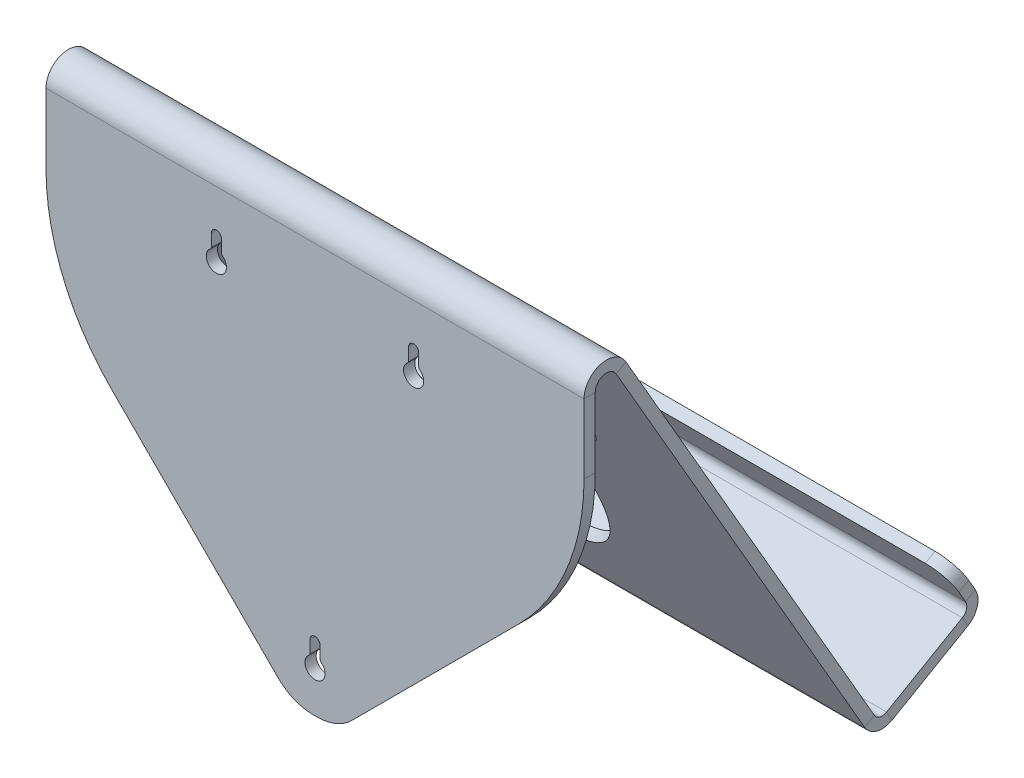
ISO-10303-21;
HEADER;
FILE_DESCRIPTION(('STEP AP214'),'2;1');
FILE_NAME('part.step','',(''),(''),'','','');
FILE_SCHEMA(('AUTOMOTIVE_DESIGN { 1 0 10303 214 1 1 1 1 }'));
ENDSEC;
DATA;
#1=APPLICATION_CONTEXT('core data for automotive mechanical design processes');
#2=APPLICATION_PROTOCOL_DEFINITION('international standard','automotive_design',2000,#1);
#3=PRODUCT_CONTEXT('',#1,'mechanical');
#4=PRODUCT('Part','Part','',(#3));
#5=PRODUCT_RELATED_PRODUCT_CATEGORY('part','',(#4));
#6=PRODUCT_DEFINITION_FORMATION('','',#4);
#7=PRODUCT_DEFINITION_CONTEXT('part definition',#1,'design');
#8=PRODUCT_DEFINITION('design','',#6,#7);
#9=PRODUCT_DEFINITION_SHAPE('','',#8);
#10=(LENGTH_UNIT() NAMED_UNIT(*) SI_UNIT(.MILLI.,.METRE.));
#11=(NAMED_UNIT(*) PLANE_ANGLE_UNIT() SI_UNIT($,.RADIAN.));
#12=(NAMED_UNIT(*) SI_UNIT($,.STERADIAN.) SOLID_ANGLE_UNIT());
#13=UNCERTAINTY_MEASURE_WITH_UNIT(LENGTH_MEASURE(1.E-05),#10,'distance_accuracy_value','');
#14=(GEOMETRIC_REPRESENTATION_CONTEXT(3) GLOBAL_UNCERTAINTY_ASSIGNED_CONTEXT((#13)) GLOBAL_UNIT_ASSIGNED_CONTEXT((#10,
#11,#12)) REPRESENTATION_CONTEXT('',''));
#15=CARTESIAN_POINT('',(0.,0.,0.));
#16=DIRECTION('',(0.,0.,1.));
#17=DIRECTION('',(1.,0.,0.));
#18=AXIS2_PLACEMENT_3D('',#15,#16,#17);
#19=CARTESIAN_POINT('',(240.,197.444173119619,-18.6602540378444));
#20=DIRECTION('',(0.,0.499999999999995,-0.866025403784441));
#21=DIRECTION('',(0.,0.866025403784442,0.499999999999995));
#22=AXIS2_PLACEMENT_3D('',#19,#20,#21);
#23=PLANE('',#22);
#24=CARTESIAN_POINT('',(175.,134.068874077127,-55.2499999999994));
#25=DIRECTION('',(0.,0.499999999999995,-0.866025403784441));
#26=DIRECTION('',(0.,0.866025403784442,0.499999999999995));
#27=AXIS2_PLACEMENT_3D('',#24,#25,#26);
#28=CIRCLE('',#27,17.5);
#29=CARTESIAN_POINT('',(177.645307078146,119.087576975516,-63.8994559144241));
#30=VERTEX_POINT('',#29);
#31=CARTESIAN_POINT('',(189.670623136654,142.331265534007,-50.47970606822));
#32=VERTEX_POINT('',#31);
#33=EDGE_CURVE('E355',#30,#32,#28,.F.);
#34=ORIENTED_EDGE('',*,*,#33,.T.);
#35=CARTESIAN_POINT('',(120.,103.093262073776,-73.1337779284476));
#36=DIRECTION('',(0.,0.499999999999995,-0.866025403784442));
#37=DIRECTION('',(0.,-0.866025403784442,-0.499999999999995));
#38=AXIS2_PLACEMENT_3D('',#35,#36,#37);
#39=CIRCLE('',#38,83.1073018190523);
#40=CARTESIAN_POINT('',(50.3293768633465,142.331265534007,-50.47970606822));
#41=VERTEX_POINT('',#40);
#42=EDGE_CURVE('E51',#41,#32,#39,.T.);
#43=ORIENTED_EDGE('',*,*,#42,.F.);
#44=CARTESIAN_POINT('',(65.,134.068874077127,-55.2499999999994));
#45=DIRECTION('',(0.,0.499999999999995,-0.866025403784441));
#46=DIRECTION('',(0.,0.866025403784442,0.499999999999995));
#47=AXIS2_PLACEMENT_3D('',#44,#45,#46);
#48=CIRCLE('',#47,17.5);
#49=CARTESIAN_POINT('',(62.3546929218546,119.087576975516,-63.8994559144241));
#50=VERTEX_POINT('',#49);
#51=EDGE_CURVE('E352',#50,#41,#48,.T.);
#52=ORIENTED_EDGE('',*,*,#51,.F.);
#53=CARTESIAN_POINT('',(60.0872868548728,106.246465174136,-71.3132752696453));
#54=DIRECTION('',(0.,0.499999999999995,-0.866025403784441));
#55=DIRECTION('',(0.,0.866025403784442,0.499999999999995));
#56=AXIS2_PLACEMENT_3D('',#53,#54,#55);
#57=CIRCLE('',#56,15.);
#58=CARTESIAN_POINT('',(75.0798157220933,105.836515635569,-71.5499597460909));
#59=VERTEX_POINT('',#58);
#60=EDGE_CURVE('E614',#50,#59,#57,.T.);
#61=ORIENTED_EDGE('',*,*,#60,.T.);
#62=CARTESIAN_POINT('',(120.,101.454137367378,-74.0801270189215));
#63=DIRECTION('',(0.,0.499999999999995,-0.866025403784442));
#64=DIRECTION('',(0.,-0.866025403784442,-0.499999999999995));
#65=AXIS2_PLACEMENT_3D('',#62,#63,#64);
#66=ELLIPSE('',#65,85.,45.);
#67=CARTESIAN_POINT('',(164.920184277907,105.836515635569,-71.5499597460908));
#68=VERTEX_POINT('',#67);
#69=EDGE_CURVE('E404',#68,#59,#66,.T.);
#70=ORIENTED_EDGE('',*,*,#69,.F.);
#71=CARTESIAN_POINT('',(179.912713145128,106.246465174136,-71.3132752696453));
#72=DIRECTION('',(0.,0.499999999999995,-0.866025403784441));
#73=DIRECTION('',(0.,0.866025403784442,0.499999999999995));
#74=AXIS2_PLACEMENT_3D('',#71,#72,#73);
#75=CIRCLE('',#74,15.);
#76=EDGE_CURVE('E628',#68,#30,#75,.T.);
#77=ORIENTED_EDGE('',*,*,#76,.T.);
#78=EDGE_LOOP('',(#34,#43,#52,#61,#70,#77));
#79=FACE_BOUND('',#78,.T.);
#80=DIRECTION('',(0.,-0.866025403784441,-0.499999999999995));
#81=VECTOR('',#80,1.);
#82=CARTESIAN_POINT('',(0.,197.444173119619,-18.6602540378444));
#83=LINE('',#82,#81);
#84=CARTESIAN_POINT('',(0.,197.444173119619,-18.6602540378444));
#85=VERTEX_POINT('',#84);
#86=CARTESIAN_POINT('',(0.,5.46410161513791,-129.499999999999));
#87=VERTEX_POINT('',#86);
#88=EDGE_CURVE('E810',#85,#87,#83,.T.);
#89=ORIENTED_EDGE('',*,*,#88,.F.);
#90=DIRECTION('',(-1.,0.,0.));
#91=VECTOR('',#90,1.);
#92=CARTESIAN_POINT('',(240.,197.444173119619,-18.6602540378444));
#93=LINE('',#92,#91);
#94=CARTESIAN_POINT('',(240.,197.444173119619,-18.6602540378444));
#95=VERTEX_POINT('',#94);
#96=EDGE_CURVE('E860',#95,#85,#93,.T.);
#97=ORIENTED_EDGE('',*,*,#96,.F.);
#98=DIRECTION('',(0.,-0.866025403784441,-0.499999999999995));
#99=VECTOR('',#98,1.);
#100=CARTESIAN_POINT('',(240.,197.444173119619,-18.6602540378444));
#101=LINE('',#100,#99);
#102=CARTESIAN_POINT('',(240.,5.46410161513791,-129.499999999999));
#103=VERTEX_POINT('',#102);
#104=EDGE_CURVE('E770',#95,#103,#101,.T.);
#105=ORIENTED_EDGE('',*,*,#104,.T.);
#106=DIRECTION('',(-1.,0.,0.));
#107=VECTOR('',#106,1.);
#108=CARTESIAN_POINT('',(240.,5.46410161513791,-129.499999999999));
#109=LINE('',#108,#107);
#110=EDGE_CURVE('E863',#103,#87,#109,.T.);
#111=ORIENTED_EDGE('',*,*,#110,.T.);
#112=EDGE_LOOP('',(#89,#97,#105,#111));
#113=FACE_BOUND('',#112,.T.);
#114=ADVANCED_FACE('F37',(#79,#113),#23,.T.);
#115=CARTESIAN_POINT('',(240.,194.944173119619,-14.3301270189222));
#116=DIRECTION('',(0.,0.499999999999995,-0.866025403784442));
#117=DIRECTION('',(0.,0.866025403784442,0.499999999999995));
#118=AXIS2_PLACEMENT_3D('',#115,#116,#117);
#119=PLANE('',#118);
#120=DIRECTION('',(0.,-0.866025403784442,-0.499999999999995));
#121=VECTOR('',#120,1.);
#122=CARTESIAN_POINT('',(0.,194.944173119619,-14.3301270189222));
#123=LINE('',#122,#121);
#124=CARTESIAN_POINT('',(0.,194.944173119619,-14.3301270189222));
#125=VERTEX_POINT('',#124);
#126=CARTESIAN_POINT('',(0.,2.96410161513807,-125.169872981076));
#127=VERTEX_POINT('',#126);
#128=EDGE_CURVE('E823',#125,#127,#123,.T.);
#129=ORIENTED_EDGE('',*,*,#128,.T.);
#130=DIRECTION('',(-1.,0.,0.));
#131=VECTOR('',#130,1.);
#132=CARTESIAN_POINT('',(240.,2.96410161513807,-125.169872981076));
#133=LINE('',#132,#131);
#134=CARTESIAN_POINT('',(240.,2.96410161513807,-125.169872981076));
#135=VERTEX_POINT('',#134);
#136=EDGE_CURVE('E842',#135,#127,#133,.T.);
#137=ORIENTED_EDGE('',*,*,#136,.F.);
#138=DIRECTION('',(0.,-0.866025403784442,-0.499999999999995));
#139=VECTOR('',#138,1.);
#140=CARTESIAN_POINT('',(240.,194.944173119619,-14.3301270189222));
#141=LINE('',#140,#139);
#142=CARTESIAN_POINT('',(240.,194.944173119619,-14.3301270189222));
#143=VERTEX_POINT('',#142);
#144=EDGE_CURVE('E783',#143,#135,#141,.T.);
#145=ORIENTED_EDGE('',*,*,#144,.F.);
#146=DIRECTION('',(-1.,0.,0.));
#147=VECTOR('',#146,1.);
#148=CARTESIAN_POINT('',(240.,194.944173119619,-14.3301270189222));
#149=LINE('',#148,#147);
#150=EDGE_CURVE('E845',#143,#125,#149,.T.);
#151=ORIENTED_EDGE('',*,*,#150,.T.);
#152=EDGE_LOOP('',(#129,#137,#145,#151));
#153=FACE_BOUND('',#152,.T.);
#154=CARTESIAN_POINT('',(65.,131.568874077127,-50.9198729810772));
#155=DIRECTION('',(0.,-0.499999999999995,0.866025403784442));
#156=DIRECTION('',(0.,-0.866025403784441,-0.499999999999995));
#157=AXIS2_PLACEMENT_3D('',#154,#155,#156);
#158=CIRCLE('',#157,17.5);
#159=CARTESIAN_POINT('',(50.3293768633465,139.831265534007,-46.1495790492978));
#160=VERTEX_POINT('',#159);
#161=CARTESIAN_POINT('',(62.3546929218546,116.587576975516,-59.5693288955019));
#162=VERTEX_POINT('',#161);
#163=EDGE_CURVE('E361',#160,#162,#158,.T.);
#164=ORIENTED_EDGE('',*,*,#163,.F.);
#165=CARTESIAN_POINT('',(120.,100.593262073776,-68.8036509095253));
#166=DIRECTION('',(0.,0.499999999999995,-0.866025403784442));
#167=DIRECTION('',(0.,0.866025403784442,0.499999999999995));
#168=AXIS2_PLACEMENT_3D('',#165,#166,#167);
#169=CIRCLE('',#168,83.1073018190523);
#170=CARTESIAN_POINT('',(189.670623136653,139.831265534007,-46.1495790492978));
#171=VERTEX_POINT('',#170);
#172=EDGE_CURVE('E342',#160,#171,#169,.T.);
#173=ORIENTED_EDGE('',*,*,#172,.T.);
#174=CARTESIAN_POINT('',(175.,131.568874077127,-50.9198729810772));
#175=DIRECTION('',(0.,0.499999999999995,-0.866025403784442));
#176=DIRECTION('',(0.,-0.866025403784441,-0.499999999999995));
#177=AXIS2_PLACEMENT_3D('',#174,#175,#176);
#178=CIRCLE('',#177,17.5);
#179=CARTESIAN_POINT('',(177.645307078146,116.587576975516,-59.5693288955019));
#180=VERTEX_POINT('',#179);
#181=EDGE_CURVE('E639',#171,#180,#178,.T.);
#182=ORIENTED_EDGE('',*,*,#181,.T.);
#183=CARTESIAN_POINT('',(179.912713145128,103.746465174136,-66.9831482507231));
#184=DIRECTION('',(0.,0.499999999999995,-0.866025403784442));
#185=DIRECTION('',(0.,0.866025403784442,0.499999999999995));
#186=AXIS2_PLACEMENT_3D('',#183,#184,#185);
#187=CIRCLE('',#186,15.);
#188=CARTESIAN_POINT('',(164.920184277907,103.336515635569,-67.2198327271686));
#189=VERTEX_POINT('',#188);
#190=EDGE_CURVE('E59',#180,#189,#187,.F.);
#191=ORIENTED_EDGE('',*,*,#190,.T.);
#192=CARTESIAN_POINT('',(120.,98.9541373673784,-69.7499999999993));
#193=DIRECTION('',(0.,0.499999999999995,-0.866025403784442));
#194=DIRECTION('',(0.,-0.866025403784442,-0.499999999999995));
#195=AXIS2_PLACEMENT_3D('',#192,#193,#194);
#196=ELLIPSE('',#195,85.,45.);
#197=CARTESIAN_POINT('',(75.0798157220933,103.336515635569,-67.2198327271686));
#198=VERTEX_POINT('',#197);
#199=EDGE_CURVE('E634',#189,#198,#196,.T.);
#200=ORIENTED_EDGE('',*,*,#199,.T.);
#201=CARTESIAN_POINT('',(60.0872868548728,103.746465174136,-66.9831482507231));
#202=DIRECTION('',(0.,0.499999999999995,-0.866025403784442));
#203=DIRECTION('',(0.,0.866025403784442,0.499999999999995));
#204=AXIS2_PLACEMENT_3D('',#201,#202,#203);
#205=CIRCLE('',#204,15.);
#206=EDGE_CURVE('E619',#198,#162,#205,.F.);
#207=ORIENTED_EDGE('',*,*,#206,.T.);
#208=EDGE_LOOP('',(#164,#173,#182,#191,#200,#207));
#209=FACE_BOUND('',#208,.T.);
#210=ADVANCED_FACE('F414',(#153,#209),#119,.F.);
#211=CARTESIAN_POINT('',(120.,96.4541373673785,-65.4198729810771));
#212=DIRECTION('',(0.,0.499999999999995,-0.866025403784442));
#213=DIRECTION('',(0.,-0.866025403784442,-0.499999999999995));
#214=AXIS2_PLACEMENT_3D('',#211,#212,#213);
#215=ELLIPSE('',#214,85.,45.);
#216=DIRECTION('',(0.,0.499999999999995,-0.866025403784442));
#217=VECTOR('',#216,1.);
#218=SURFACE_OF_LINEAR_EXTRUSION('',#215,#217);
#219=ORIENTED_EDGE('',*,*,#199,.F.);
#220=DIRECTION('',(0.,0.499999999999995,-0.866025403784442));
#221=VECTOR('',#220,1.);
#222=CARTESIAN_POINT('',(164.920184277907,103.336515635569,-67.2198327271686));
#223=LINE('',#222,#221);
#224=EDGE_CURVE('E45',#189,#68,#223,.T.);
#225=ORIENTED_EDGE('',*,*,#224,.T.);
#226=ORIENTED_EDGE('',*,*,#69,.T.);
#227=DIRECTION('',(0.,0.499999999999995,-0.866025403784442));
#228=VECTOR('',#227,1.);
#229=CARTESIAN_POINT('',(75.0798157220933,105.836515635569,-71.5499597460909));
#230=LINE('',#229,#228);
#231=EDGE_CURVE('E617',#59,#198,#230,.F.);
#232=ORIENTED_EDGE('',*,*,#231,.T.);
#233=EDGE_LOOP('',(#219,#225,#226,#232));
#234=FACE_BOUND('',#233,.T.);
#235=ADVANCED_FACE('F409',(#234),#218,.F.);
#236=CARTESIAN_POINT('',(120.,38.4441731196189,0.));
#237=DIRECTION('',(0.,0.,1.));
#238=DIRECTION('',(1.,0.,0.));
#239=AXIS2_PLACEMENT_3D('',#236,#237,#238);
#240=CYLINDRICAL_SURFACE('',#239,2.25);
#241=DIRECTION('',(0.,0.,1.));
#242=VECTOR('',#241,1.);
#243=CARTESIAN_POINT('',(122.25,38.4441731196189,0.));
#244=LINE('',#243,#242);
#245=CARTESIAN_POINT('',(122.25,38.4441731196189,0.));
#246=VERTEX_POINT('',#245);
#247=CARTESIAN_POINT('',(122.25,38.4441731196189,-5.));
#248=VERTEX_POINT('',#247);
#249=EDGE_CURVE('E662',#246,#248,#244,.F.);
#250=ORIENTED_EDGE('',*,*,#249,.F.);
#251=CARTESIAN_POINT('',(120.,38.4441731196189,0.));
#252=DIRECTION('',(0.,0.,1.));
#253=DIRECTION('',(1.,0.,0.));
#254=AXIS2_PLACEMENT_3D('',#251,#252,#253);
#255=CIRCLE('',#254,2.25);
#256=CARTESIAN_POINT('',(117.75,38.4441731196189,0.));
#257=VERTEX_POINT('',#256);
#258=EDGE_CURVE('E642',#246,#257,#255,.T.);
#259=ORIENTED_EDGE('',*,*,#258,.T.);
#260=DIRECTION('',(0.,0.,1.));
#261=VECTOR('',#260,1.);
#262=CARTESIAN_POINT('',(117.75,38.4441731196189,0.));
#263=LINE('',#262,#261);
#264=CARTESIAN_POINT('',(117.75,38.4441731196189,-5.));
#265=VERTEX_POINT('',#264);
#266=EDGE_CURVE('E659',#257,#265,#263,.F.);
#267=ORIENTED_EDGE('',*,*,#266,.T.);
#268=CARTESIAN_POINT('',(120.,38.4441731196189,-5.));
#269=DIRECTION('',(0.,0.,1.));
#270=DIRECTION('',(1.,0.,0.));
#271=AXIS2_PLACEMENT_3D('',#268,#269,#270);
#272=CIRCLE('',#271,2.25);
#273=EDGE_CURVE('E645',#248,#265,#272,.T.);
#274=ORIENTED_EDGE('',*,*,#273,.F.);
#275=EDGE_LOOP('',(#250,#259,#267,#274));
#276=FACE_BOUND('',#275,.T.);
#277=ADVANCED_FACE('F413',(#276),#240,.F.);
#278=CARTESIAN_POINT('',(240.,197.444173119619,-18.6602540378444));
#279=DIRECTION('',(1.,0.,0.));
#280=DIRECTION('',(0.,0.,-1.));
#281=AXIS2_PLACEMENT_3D('',#278,#279,#280);
#282=PLANE('',#281);
#283=DIRECTION('',(0.,-0.499999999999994,0.866025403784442));
#284=VECTOR('',#283,1.);
#285=CARTESIAN_POINT('',(240.,197.444173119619,-18.6602540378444));
#286=LINE('',#285,#284);
#287=EDGE_CURVE('E905',#95,#143,#286,.T.);
#288=ORIENTED_EDGE('',*,*,#287,.F.);
#289=CARTESIAN_POINT('',(240.,192.444173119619,-10.));
#290=DIRECTION('',(-1.,0.,0.));
#291=DIRECTION('',(0.,0.,1.));
#292=AXIS2_PLACEMENT_3D('',#289,#290,#291);
#293=CIRCLE('',#292,10.);
#294=CARTESIAN_POINT('',(240.,192.444173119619,0.));
#295=VERTEX_POINT('',#294);
#296=EDGE_CURVE('E773',#295,#95,#293,.T.);
#297=ORIENTED_EDGE('',*,*,#296,.F.);
#298=DIRECTION('',(0.,0.,1.));
#299=VECTOR('',#298,1.);
#300=CARTESIAN_POINT('',(240.,192.444173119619,-5.00000000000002));
#301=LINE('',#300,#299);
#302=CARTESIAN_POINT('',(240.,192.444173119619,-5.00000000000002));
#303=VERTEX_POINT('',#302);
#304=EDGE_CURVE('E902',#303,#295,#301,.T.);
#305=ORIENTED_EDGE('',*,*,#304,.F.);
#306=CARTESIAN_POINT('',(240.,192.444173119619,-10.));
#307=DIRECTION('',(1.,0.,0.));
#308=DIRECTION('',(0.,0.,-1.));
#309=AXIS2_PLACEMENT_3D('',#306,#307,#308);
#310=CIRCLE('',#309,5.);
#311=EDGE_CURVE('E780',#303,#143,#310,.F.);
#312=ORIENTED_EDGE('',*,*,#311,.T.);
#313=EDGE_LOOP('',(#288,#297,#305,#312));
#314=FACE_BOUND('',#313,.T.);
#315=ADVANCED_FACE('F420',(#314),#282,.T.);
#316=CARTESIAN_POINT('',(240.,192.444173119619,-5.00000000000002));
#317=DIRECTION('',(1.,0.,0.));
#318=DIRECTION('',(0.,0.,-1.));
#319=AXIS2_PLACEMENT_3D('',#316,#317,#318);
#320=PLANE('',#319);
#321=ORIENTED_EDGE('',*,*,#104,.F.);
#322=ORIENTED_EDGE('',*,*,#287,.T.);
#323=ORIENTED_EDGE('',*,*,#144,.T.);
#324=DIRECTION('',(0.,0.49999999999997,-0.866025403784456));
#325=VECTOR('',#324,1.);
#326=CARTESIAN_POINT('',(240.,2.96410161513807,-125.169872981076));
#327=LINE('',#326,#325);
#328=EDGE_CURVE('E893',#135,#103,#327,.T.);
#329=ORIENTED_EDGE('',*,*,#328,.T.);
#330=EDGE_LOOP('',(#321,#322,#323,#329));
#331=FACE_BOUND('',#330,.T.);
#332=ADVANCED_FACE('F540',(#331),#320,.T.);
#333=CARTESIAN_POINT('',(0.,192.444173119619,0.));
#334=DIRECTION('',(-1.,0.,0.));
#335=DIRECTION('',(0.,0.,1.));
#336=AXIS2_PLACEMENT_3D('',#333,#334,#335);
#337=PLANE('',#336);
#338=DIRECTION('',(0.,0.,-1.));
#339=VECTOR('',#338,1.);
#340=CARTESIAN_POINT('',(0.,192.444173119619,0.));
#341=LINE('',#340,#339);
#342=CARTESIAN_POINT('',(0.,192.444173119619,0.));
#343=VERTEX_POINT('',#342);
#344=CARTESIAN_POINT('',(0.,192.444173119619,-5.00000000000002));
#345=VERTEX_POINT('',#344);
#346=EDGE_CURVE('E899',#343,#345,#341,.T.);
#347=ORIENTED_EDGE('',*,*,#346,.F.);
#348=CARTESIAN_POINT('',(0.,192.444173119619,-10.));
#349=DIRECTION('',(-1.,0.,0.));
#350=DIRECTION('',(0.,0.,1.));
#351=AXIS2_PLACEMENT_3D('',#348,#349,#350);
#352=CIRCLE('',#351,10.);
#353=EDGE_CURVE('E813',#343,#85,#352,.T.);
#354=ORIENTED_EDGE('',*,*,#353,.T.);
#355=DIRECTION('',(0.,0.499999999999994,-0.866025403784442));
#356=VECTOR('',#355,1.);
#357=CARTESIAN_POINT('',(0.,194.944173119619,-14.3301270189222));
#358=LINE('',#357,#356);
#359=EDGE_CURVE('E897',#125,#85,#358,.T.);
#360=ORIENTED_EDGE('',*,*,#359,.F.);
#361=CARTESIAN_POINT('',(0.,192.444173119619,-10.));
#362=DIRECTION('',(1.,0.,0.));
#363=DIRECTION('',(0.,0.,-1.));
#364=AXIS2_PLACEMENT_3D('',#361,#362,#363);
#365=CIRCLE('',#364,5.);
#366=EDGE_CURVE('E820',#345,#125,#365,.F.);
#367=ORIENTED_EDGE('',*,*,#366,.F.);
#368=EDGE_LOOP('',(#347,#354,#360,#367));
#369=FACE_BOUND('',#368,.T.);
#370=ADVANCED_FACE('F536',(#369),#337,.T.);
#371=CARTESIAN_POINT('',(0.,194.944173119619,-14.3301270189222));
#372=DIRECTION('',(-1.,0.,0.));
#373=DIRECTION('',(0.,0.,1.));
#374=AXIS2_PLACEMENT_3D('',#371,#372,#373);
#375=PLANE('',#374);
#376=DIRECTION('',(0.,1.,0.));
#377=VECTOR('',#376,1.);
#378=CARTESIAN_POINT('',(0.,10.,-5.));
#379=LINE('',#378,#377);
#380=CARTESIAN_POINT('',(0.,161.42135623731,-5.));
#381=VERTEX_POINT('',#380);
#382=EDGE_CURVE('E818',#381,#345,#379,.T.);
#383=ORIENTED_EDGE('',*,*,#382,.F.);
#384=DIRECTION('',(0.,0.,-1.));
#385=VECTOR('',#384,1.);
#386=CARTESIAN_POINT('',(0.,161.42135623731,-14.3301270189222));
#387=LINE('',#386,#385);
#388=CARTESIAN_POINT('',(0.,161.42135623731,0.));
#389=VERTEX_POINT('',#388);
#390=EDGE_CURVE('E949',#381,#389,#387,.F.);
#391=ORIENTED_EDGE('',*,*,#390,.T.);
#392=DIRECTION('',(0.,1.,0.));
#393=VECTOR('',#392,1.);
#394=CARTESIAN_POINT('',(0.,10.,0.));
#395=LINE('',#394,#393);
#396=EDGE_CURVE('E816',#389,#343,#395,.T.);
#397=ORIENTED_EDGE('',*,*,#396,.T.);
#398=ORIENTED_EDGE('',*,*,#346,.T.);
#399=EDGE_LOOP('',(#383,#391,#397,#398));
#400=FACE_BOUND('',#399,.T.);
#401=ADVANCED_FACE('F532',(#400),#375,.T.);
#402=CARTESIAN_POINT('',(240.,3.99999999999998,-134.964101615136));
#403=DIRECTION('',(1.,0.,0.));
#404=DIRECTION('',(0.,0.,-1.));
#405=AXIS2_PLACEMENT_3D('',#402,#403,#404);
#406=PLANE('',#405);
#407=DIRECTION('',(0.,-0.866025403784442,-0.499999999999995));
#408=VECTOR('',#407,1.);
#409=CARTESIAN_POINT('',(240.,3.99999999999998,-134.964101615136));
#410=LINE('',#409,#408);
#411=CARTESIAN_POINT('',(240.,3.99999999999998,-134.964101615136));
#412=VERTEX_POINT('',#411);
#413=CARTESIAN_POINT('',(240.,-0.330127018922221,-137.464101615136));
#414=VERTEX_POINT('',#413);
#415=EDGE_CURVE('E895',#412,#414,#410,.T.);
#416=ORIENTED_EDGE('',*,*,#415,.F.);
#417=CARTESIAN_POINT('',(240.,7.46410161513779,-132.964101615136));
#418=DIRECTION('',(-1.,0.,0.));
#419=DIRECTION('',(0.,0.,1.));
#420=AXIS2_PLACEMENT_3D('',#417,#418,#419);
#421=CIRCLE('',#420,4.);
#422=EDGE_CURVE('E767',#103,#412,#421,.F.);
#423=ORIENTED_EDGE('',*,*,#422,.F.);
#424=ORIENTED_EDGE('',*,*,#328,.F.);
#425=CARTESIAN_POINT('',(240.,7.46410161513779,-132.964101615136));
#426=DIRECTION('',(1.,0.,0.));
#427=DIRECTION('',(0.,0.,-1.));
#428=AXIS2_PLACEMENT_3D('',#425,#426,#427);
#429=CIRCLE('',#428,9.);
#430=EDGE_CURVE('E786',#135,#414,#429,.T.);
#431=ORIENTED_EDGE('',*,*,#430,.T.);
#432=EDGE_LOOP('',(#416,#423,#424,#431));
#433=FACE_BOUND('',#432,.T.);
#434=ADVANCED_FACE('F528',(#433),#406,.T.);
#435=CARTESIAN_POINT('',(240.,2.96410161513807,-125.169872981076));
#436=DIRECTION('',(1.,0.,0.));
#437=DIRECTION('',(0.,0.,-1.));
#438=AXIS2_PLACEMENT_3D('',#435,#436,#437);
#439=PLANE('',#438);
#440=DIRECTION('',(0.,0.499999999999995,-0.866025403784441));
#441=VECTOR('',#440,1.);
#442=CARTESIAN_POINT('',(240.,2.,-131.499999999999));
#443=LINE('',#442,#441);
#444=CARTESIAN_POINT('',(240.,23.4999999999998,-168.73909236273));
#445=VERTEX_POINT('',#444);
#446=EDGE_CURVE('E764',#412,#445,#443,.T.);
#447=ORIENTED_EDGE('',*,*,#446,.F.);
#448=ORIENTED_EDGE('',*,*,#415,.T.);
#449=DIRECTION('',(0.,0.499999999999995,-0.866025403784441));
#450=VECTOR('',#449,1.);
#451=CARTESIAN_POINT('',(240.,-2.33012701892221,-133.999999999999));
#452=LINE('',#451,#450);
#453=CARTESIAN_POINT('',(240.,19.1698729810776,-171.23909236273));
#454=VERTEX_POINT('',#453);
#455=EDGE_CURVE('E789',#414,#454,#452,.T.);
#456=ORIENTED_EDGE('',*,*,#455,.T.);
#457=DIRECTION('',(0.,0.866025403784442,0.499999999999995));
#458=VECTOR('',#457,1.);
#459=CARTESIAN_POINT('',(240.,19.1698729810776,-171.23909236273));
#460=LINE('',#459,#458);
#461=EDGE_CURVE('E885',#454,#445,#460,.T.);
#462=ORIENTED_EDGE('',*,*,#461,.T.);
#463=EDGE_LOOP('',(#447,#448,#456,#462));
#464=FACE_BOUND('',#463,.T.);
#465=ADVANCED_FACE('F524',(#464),#439,.T.);
#466=CARTESIAN_POINT('',(0.,5.46410161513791,-129.499999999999));
#467=DIRECTION('',(-1.,0.,0.));
#468=DIRECTION('',(0.,0.,1.));
#469=AXIS2_PLACEMENT_3D('',#466,#467,#468);
#470=PLANE('',#469);
#471=DIRECTION('',(0.,-0.49999999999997,0.866025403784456));
#472=VECTOR('',#471,1.);
#473=CARTESIAN_POINT('',(0.,5.46410161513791,-129.499999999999));
#474=LINE('',#473,#472);
#475=EDGE_CURVE('E891',#87,#127,#474,.T.);
#476=ORIENTED_EDGE('',*,*,#475,.F.);
#477=CARTESIAN_POINT('',(0.,7.46410161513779,-132.964101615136));
#478=DIRECTION('',(-1.,0.,0.));
#479=DIRECTION('',(0.,0.,1.));
#480=AXIS2_PLACEMENT_3D('',#477,#478,#479);
#481=CIRCLE('',#480,4.);
#482=CARTESIAN_POINT('',(0.,3.99999999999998,-134.964101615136));
#483=VERTEX_POINT('',#482);
#484=EDGE_CURVE('E807',#87,#483,#481,.F.);
#485=ORIENTED_EDGE('',*,*,#484,.T.);
#486=DIRECTION('',(0.,0.866025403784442,0.499999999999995));
#487=VECTOR('',#486,1.);
#488=CARTESIAN_POINT('',(0.,-0.330127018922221,-137.464101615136));
#489=LINE('',#488,#487);
#490=CARTESIAN_POINT('',(0.,-0.330127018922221,-137.464101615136));
#491=VERTEX_POINT('',#490);
#492=EDGE_CURVE('E889',#491,#483,#489,.T.);
#493=ORIENTED_EDGE('',*,*,#492,.F.);
#494=CARTESIAN_POINT('',(0.,7.46410161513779,-132.964101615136));
#495=DIRECTION('',(1.,0.,0.));
#496=DIRECTION('',(0.,0.,-1.));
#497=AXIS2_PLACEMENT_3D('',#494,#495,#496);
#498=CIRCLE('',#497,9.);
#499=EDGE_CURVE('E826',#127,#491,#498,.T.);
#500=ORIENTED_EDGE('',*,*,#499,.F.);
#501=EDGE_LOOP('',(#476,#485,#493,#500));
#502=FACE_BOUND('',#501,.T.);
#503=ADVANCED_FACE('F520',(#502),#470,.T.);
#504=CARTESIAN_POINT('',(0.,-0.330127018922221,-137.464101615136));
#505=DIRECTION('',(-1.,0.,0.));
#506=DIRECTION('',(0.,0.,1.));
#507=AXIS2_PLACEMENT_3D('',#504,#505,#506);
#508=PLANE('',#507);
#509=ORIENTED_EDGE('',*,*,#88,.T.);
#510=ORIENTED_EDGE('',*,*,#475,.T.);
#511=ORIENTED_EDGE('',*,*,#128,.F.);
#512=ORIENTED_EDGE('',*,*,#359,.T.);
#513=EDGE_LOOP('',(#509,#510,#511,#512));
#514=FACE_BOUND('',#513,.T.);
#515=ADVANCED_FACE('F516',(#514),#508,.T.);
#516=CARTESIAN_POINT('',(240.,28.9641016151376,-170.203193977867));
#517=DIRECTION('',(1.,0.,0.));
#518=DIRECTION('',(0.,0.,-1.));
#519=AXIS2_PLACEMENT_3D('',#516,#517,#518);
#520=PLANE('',#519);
#521=DIRECTION('',(0.,0.499999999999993,-0.866025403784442));
#522=VECTOR('',#521,1.);
#523=CARTESIAN_POINT('',(240.,28.9641016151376,-170.203193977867));
#524=LINE('',#523,#522);
#525=CARTESIAN_POINT('',(240.,28.9641016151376,-170.203193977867));
#526=VERTEX_POINT('',#525);
#527=CARTESIAN_POINT('',(240.,31.4641016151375,-174.53332099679));
#528=VERTEX_POINT('',#527);
#529=EDGE_CURVE('E887',#526,#528,#524,.T.);
#530=ORIENTED_EDGE('',*,*,#529,.F.);
#531=CARTESIAN_POINT('',(240.,26.9641016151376,-166.73909236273));
#532=DIRECTION('',(-1.,0.,0.));
#533=DIRECTION('',(0.,0.,1.));
#534=AXIS2_PLACEMENT_3D('',#531,#532,#533);
#535=CIRCLE('',#534,4.);
#536=EDGE_CURVE('E761',#445,#526,#535,.F.);
#537=ORIENTED_EDGE('',*,*,#536,.F.);
#538=ORIENTED_EDGE('',*,*,#461,.F.);
#539=CARTESIAN_POINT('',(240.,26.9641016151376,-166.73909236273));
#540=DIRECTION('',(1.,0.,0.));
#541=DIRECTION('',(0.,0.,-1.));
#542=AXIS2_PLACEMENT_3D('',#539,#540,#541);
#543=CIRCLE('',#542,9.);
#544=EDGE_CURVE('E792',#454,#528,#543,.T.);
#545=ORIENTED_EDGE('',*,*,#544,.T.);
#546=EDGE_LOOP('',(#530,#537,#538,#545));
#547=FACE_BOUND('',#546,.T.);
#548=ADVANCED_FACE('F512',(#547),#520,.T.);
#549=CARTESIAN_POINT('',(240.,19.1698729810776,-171.23909236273));
#550=DIRECTION('',(1.,0.,0.));
#551=DIRECTION('',(0.,0.,-1.));
#552=AXIS2_PLACEMENT_3D('',#549,#550,#551);
#553=PLANE('',#552);
#554=DIRECTION('',(0.,0.866025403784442,0.499999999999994));
#555=VECTOR('',#554,1.);
#556=CARTESIAN_POINT('',(240.,27.9999999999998,-176.53332099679));
#557=LINE('',#556,#555);
#558=CARTESIAN_POINT('',(240.,36.6602540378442,-171.53332099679));
#559=VERTEX_POINT('',#558);
#560=EDGE_CURVE('E754',#528,#559,#557,.T.);
#561=ORIENTED_EDGE('',*,*,#560,.T.);
#562=DIRECTION('',(0.,0.499999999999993,-0.866025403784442));
#563=VECTOR('',#562,1.);
#564=CARTESIAN_POINT('',(240.,32.1602540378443,-163.73909236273));
#565=LINE('',#564,#563);
#566=CARTESIAN_POINT('',(240.,34.1602540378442,-167.203193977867));
#567=VERTEX_POINT('',#566);
#568=EDGE_CURVE('E923',#559,#567,#565,.F.);
#569=ORIENTED_EDGE('',*,*,#568,.T.);
#570=DIRECTION('',(0.,0.866025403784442,0.499999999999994));
#571=VECTOR('',#570,1.);
#572=CARTESIAN_POINT('',(240.,25.4999999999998,-172.203193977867));
#573=LINE('',#572,#571);
#574=EDGE_CURVE('E757',#526,#567,#573,.T.);
#575=ORIENTED_EDGE('',*,*,#574,.F.);
#576=ORIENTED_EDGE('',*,*,#529,.T.);
#577=EDGE_LOOP('',(#561,#569,#575,#576));
#578=FACE_BOUND('',#577,.T.);
#579=ADVANCED_FACE('F508',(#578),#553,.T.);
#580=CARTESIAN_POINT('',(0.,23.4999999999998,-168.73909236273));
#581=DIRECTION('',(-1.,0.,0.));
#582=DIRECTION('',(0.,0.,1.));
#583=AXIS2_PLACEMENT_3D('',#580,#581,#582);
#584=PLANE('',#583);
#585=DIRECTION('',(0.,-0.866025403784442,-0.499999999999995));
#586=VECTOR('',#585,1.);
#587=CARTESIAN_POINT('',(0.,23.4999999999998,-168.73909236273));
#588=LINE('',#587,#586);
#589=CARTESIAN_POINT('',(0.,23.4999999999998,-168.73909236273));
#590=VERTEX_POINT('',#589);
#591=CARTESIAN_POINT('',(0.,19.1698729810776,-171.23909236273));
#592=VERTEX_POINT('',#591);
#593=EDGE_CURVE('E883',#590,#592,#588,.T.);
#594=ORIENTED_EDGE('',*,*,#593,.F.);
#595=CARTESIAN_POINT('',(0.,26.9641016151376,-166.73909236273));
#596=DIRECTION('',(-1.,0.,0.));
#597=DIRECTION('',(0.,0.,1.));
#598=AXIS2_PLACEMENT_3D('',#595,#596,#597);
#599=CIRCLE('',#598,4.);
#600=CARTESIAN_POINT('',(0.,28.9641016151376,-170.203193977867));
#601=VERTEX_POINT('',#600);
#602=EDGE_CURVE('E801',#590,#601,#599,.F.);
#603=ORIENTED_EDGE('',*,*,#602,.T.);
#604=DIRECTION('',(0.,-0.499999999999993,0.866025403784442));
#605=VECTOR('',#604,1.);
#606=CARTESIAN_POINT('',(0.,31.4641016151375,-174.53332099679));
#607=LINE('',#606,#605);
#608=CARTESIAN_POINT('',(0.,31.4641016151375,-174.53332099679));
#609=VERTEX_POINT('',#608);
#610=EDGE_CURVE('E881',#609,#601,#607,.T.);
#611=ORIENTED_EDGE('',*,*,#610,.F.);
#612=CARTESIAN_POINT('',(0.,26.9641016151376,-166.73909236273));
#613=DIRECTION('',(1.,0.,0.));
#614=DIRECTION('',(0.,0.,-1.));
#615=AXIS2_PLACEMENT_3D('',#612,#613,#614);
#616=CIRCLE('',#615,9.);
#617=EDGE_CURVE('E758',#592,#609,#616,.T.);
#618=ORIENTED_EDGE('',*,*,#617,.F.);
#619=EDGE_LOOP('',(#594,#603,#611,#618));
#620=FACE_BOUND('',#619,.T.);
#621=ADVANCED_FACE('F504',(#620),#584,.T.);
#622=CARTESIAN_POINT('',(0.,31.4641016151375,-174.53332099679));
#623=DIRECTION('',(-1.,0.,0.));
#624=DIRECTION('',(0.,0.,1.));
#625=AXIS2_PLACEMENT_3D('',#622,#623,#624);
#626=PLANE('',#625);
#627=DIRECTION('',(0.,0.499999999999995,-0.866025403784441));
#628=VECTOR('',#627,1.);
#629=CARTESIAN_POINT('',(0.,2.,-131.499999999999));
#630=LINE('',#629,#628);
#631=EDGE_CURVE('E804',#483,#590,#630,.T.);
#632=ORIENTED_EDGE('',*,*,#631,.T.);
#633=ORIENTED_EDGE('',*,*,#593,.T.);
#634=DIRECTION('',(0.,0.499999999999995,-0.866025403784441));
#635=VECTOR('',#634,1.);
#636=CARTESIAN_POINT('',(0.,-2.33012701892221,-133.999999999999));
#637=LINE('',#636,#635);
#638=EDGE_CURVE('E829',#491,#592,#637,.T.);
#639=ORIENTED_EDGE('',*,*,#638,.F.);
#640=ORIENTED_EDGE('',*,*,#492,.T.);
#641=EDGE_LOOP('',(#632,#633,#639,#640));
#642=FACE_BOUND('',#641,.T.);
#643=ADVANCED_FACE('F500',(#642),#626,.T.);
#644=CARTESIAN_POINT('',(240.,27.9999999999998,-176.53332099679));
#645=DIRECTION('',(0.,-0.499999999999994,0.866025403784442));
#646=DIRECTION('',(0.,-0.866025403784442,-0.499999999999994));
#647=AXIS2_PLACEMENT_3D('',#644,#645,#646);
#648=PLANE('',#647);
#649=DIRECTION('',(0.,0.866025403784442,0.499999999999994));
#650=VECTOR('',#649,1.);
#651=CARTESIAN_POINT('',(0.,27.9999999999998,-176.53332099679));
#652=LINE('',#651,#650);
#653=CARTESIAN_POINT('',(0.,36.6602540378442,-171.53332099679));
#654=VERTEX_POINT('',#653);
#655=EDGE_CURVE('E753',#609,#654,#652,.T.);
#656=ORIENTED_EDGE('',*,*,#655,.T.);
#657=CARTESIAN_POINT('',(10.,36.6602540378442,-171.53332099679));
#658=DIRECTION('',(0.,-0.499999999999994,0.866025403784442));
#659=DIRECTION('',(0.,-0.866025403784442,-0.499999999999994));
#660=AXIS2_PLACEMENT_3D('',#657,#658,#659);
#661=CIRCLE('',#660,10.);
#662=CARTESIAN_POINT('',(10.,45.3205080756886,-166.53332099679));
#663=VERTEX_POINT('',#662);
#664=EDGE_CURVE('E912',#654,#663,#661,.F.);
#665=ORIENTED_EDGE('',*,*,#664,.T.);
#666=DIRECTION('',(-1.,0.,0.));
#667=VECTOR('',#666,1.);
#668=CARTESIAN_POINT('',(240.,45.3205080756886,-166.53332099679));
#669=LINE('',#668,#667);
#670=CARTESIAN_POINT('',(230.,45.3205080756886,-166.53332099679));
#671=VERTEX_POINT('',#670);
#672=EDGE_CURVE('E878',#671,#663,#669,.T.);
#673=ORIENTED_EDGE('',*,*,#672,.F.);
#674=CARTESIAN_POINT('',(230.,36.6602540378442,-171.53332099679));
#675=DIRECTION('',(0.,-0.499999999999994,0.866025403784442));
#676=DIRECTION('',(0.,-0.866025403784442,-0.499999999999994));
#677=AXIS2_PLACEMENT_3D('',#674,#675,#676);
#678=CIRCLE('',#677,10.);
#679=EDGE_CURVE('E910',#671,#559,#678,.F.);
#680=ORIENTED_EDGE('',*,*,#679,.T.);
#681=ORIENTED_EDGE('',*,*,#560,.F.);
#682=DIRECTION('',(-1.,0.,0.));
#683=VECTOR('',#682,1.);
#684=CARTESIAN_POINT('',(240.,31.4641016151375,-174.53332099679));
#685=LINE('',#684,#683);
#686=EDGE_CURVE('E795',#528,#609,#685,.T.);
#687=ORIENTED_EDGE('',*,*,#686,.T.);
#688=EDGE_LOOP('',(#656,#665,#673,#680,#681,#687));
#689=FACE_BOUND('',#688,.T.);
#690=ADVANCED_FACE('F496',(#689),#648,.F.);
#691=CARTESIAN_POINT('',(240.,42.8205080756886,-162.203193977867));
#692=DIRECTION('',(0.,0.866025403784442,0.499999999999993));
#693=DIRECTION('',(0.,-0.499999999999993,0.866025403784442));
#694=AXIS2_PLACEMENT_3D('',#691,#692,#693);
#695=PLANE('',#694);
#696=ORIENTED_EDGE('',*,*,#672,.T.);
#697=DIRECTION('',(0.,0.499999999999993,-0.866025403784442));
#698=VECTOR('',#697,1.);
#699=CARTESIAN_POINT('',(10.,42.8205080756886,-162.203193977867));
#700=LINE('',#699,#698);
#701=CARTESIAN_POINT('',(10.,42.8205080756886,-162.203193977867));
#702=VERTEX_POINT('',#701);
#703=EDGE_CURVE('E917',#663,#702,#700,.F.);
#704=ORIENTED_EDGE('',*,*,#703,.T.);
#705=DIRECTION('',(-1.,0.,0.));
#706=VECTOR('',#705,1.);
#707=CARTESIAN_POINT('',(240.,42.8205080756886,-162.203193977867));
#708=LINE('',#707,#706);
#709=CARTESIAN_POINT('',(230.,42.8205080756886,-162.203193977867));
#710=VERTEX_POINT('',#709);
#711=EDGE_CURVE('E875',#710,#702,#708,.T.);
#712=ORIENTED_EDGE('',*,*,#711,.F.);
#713=DIRECTION('',(0.,0.499999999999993,-0.866025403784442));
#714=VECTOR('',#713,1.);
#715=CARTESIAN_POINT('',(230.,42.8205080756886,-162.203193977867));
#716=LINE('',#715,#714);
#717=EDGE_CURVE('E914',#710,#671,#716,.T.);
#718=ORIENTED_EDGE('',*,*,#717,.T.);
#719=EDGE_LOOP('',(#696,#704,#712,#718));
#720=FACE_BOUND('',#719,.T.);
#721=ADVANCED_FACE('F492',(#720),#695,.T.);
#722=CARTESIAN_POINT('',(240.,25.4999999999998,-172.203193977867));
#723=DIRECTION('',(0.,-0.499999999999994,0.866025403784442));
#724=DIRECTION('',(0.,-0.866025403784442,-0.499999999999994));
#725=AXIS2_PLACEMENT_3D('',#722,#723,#724);
#726=PLANE('',#725);
#727=ORIENTED_EDGE('',*,*,#711,.T.);
#728=CARTESIAN_POINT('',(10.,34.1602540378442,-167.203193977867));
#729=DIRECTION('',(0.,-0.499999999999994,0.866025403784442));
#730=DIRECTION('',(0.,-0.866025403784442,-0.499999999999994));
#731=AXIS2_PLACEMENT_3D('',#728,#729,#730);
#732=CIRCLE('',#731,10.);
#733=CARTESIAN_POINT('',(0.,34.1602540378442,-167.203193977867));
#734=VERTEX_POINT('',#733);
#735=EDGE_CURVE('E921',#702,#734,#732,.T.);
#736=ORIENTED_EDGE('',*,*,#735,.T.);
#737=DIRECTION('',(0.,0.866025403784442,0.499999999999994));
#738=VECTOR('',#737,1.);
#739=CARTESIAN_POINT('',(0.,25.4999999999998,-172.203193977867));
#740=LINE('',#739,#738);
#741=EDGE_CURVE('E798',#601,#734,#740,.T.);
#742=ORIENTED_EDGE('',*,*,#741,.F.);
#743=DIRECTION('',(-1.,0.,0.));
#744=VECTOR('',#743,1.);
#745=CARTESIAN_POINT('',(240.,28.9641016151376,-170.203193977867));
#746=LINE('',#745,#744);
#747=EDGE_CURVE('E872',#526,#601,#746,.T.);
#748=ORIENTED_EDGE('',*,*,#747,.F.);
#749=ORIENTED_EDGE('',*,*,#574,.T.);
#750=CARTESIAN_POINT('',(230.,34.1602540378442,-167.203193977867));
#751=DIRECTION('',(0.,-0.499999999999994,0.866025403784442));
#752=DIRECTION('',(0.,-0.866025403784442,-0.499999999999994));
#753=AXIS2_PLACEMENT_3D('',#750,#751,#752);
#754=CIRCLE('',#753,10.);
#755=EDGE_CURVE('E919',#567,#710,#754,.T.);
#756=ORIENTED_EDGE('',*,*,#755,.T.);
#757=EDGE_LOOP('',(#727,#736,#742,#748,#749,#756));
#758=FACE_BOUND('',#757,.T.);
#759=ADVANCED_FACE('F488',(#758),#726,.T.);
#760=CARTESIAN_POINT('',(240.,26.9641016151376,-166.73909236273));
#761=DIRECTION('',(-1.,0.,0.));
#762=DIRECTION('',(0.,0.,1.));
#763=AXIS2_PLACEMENT_3D('',#760,#761,#762);
#764=CYLINDRICAL_SURFACE('',#763,4.);
#765=ORIENTED_EDGE('',*,*,#602,.F.);
#766=DIRECTION('',(-1.,0.,0.));
#767=VECTOR('',#766,1.);
#768=CARTESIAN_POINT('',(240.,23.4999999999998,-168.73909236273));
#769=LINE('',#768,#767);
#770=EDGE_CURVE('E869',#445,#590,#769,.T.);
#771=ORIENTED_EDGE('',*,*,#770,.F.);
#772=ORIENTED_EDGE('',*,*,#536,.T.);
#773=ORIENTED_EDGE('',*,*,#747,.T.);
#774=EDGE_LOOP('',(#765,#771,#772,#773));
#775=FACE_BOUND('',#774,.T.);
#776=ADVANCED_FACE('F484',(#775),#764,.F.);
#777=CARTESIAN_POINT('',(240.,2.,-131.499999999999));
#778=DIRECTION('',(0.,0.866025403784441,0.499999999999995));
#779=DIRECTION('',(0.,-0.499999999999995,0.866025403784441));
#780=AXIS2_PLACEMENT_3D('',#777,#778,#779);
#781=PLANE('',#780);
#782=ORIENTED_EDGE('',*,*,#631,.F.);
#783=DIRECTION('',(-1.,0.,0.));
#784=VECTOR('',#783,1.);
#785=CARTESIAN_POINT('',(240.,3.99999999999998,-134.964101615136));
#786=LINE('',#785,#784);
#787=EDGE_CURVE('E866',#412,#483,#786,.T.);
#788=ORIENTED_EDGE('',*,*,#787,.F.);
#789=ORIENTED_EDGE('',*,*,#446,.T.);
#790=ORIENTED_EDGE('',*,*,#770,.T.);
#791=EDGE_LOOP('',(#782,#788,#789,#790));
#792=FACE_BOUND('',#791,.T.);
#793=ADVANCED_FACE('F480',(#792),#781,.T.);
#794=CARTESIAN_POINT('',(240.,7.46410161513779,-132.964101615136));
#795=DIRECTION('',(-1.,0.,0.));
#796=DIRECTION('',(0.,0.,1.));
#797=AXIS2_PLACEMENT_3D('',#794,#795,#796);
#798=CYLINDRICAL_SURFACE('',#797,4.);
#799=ORIENTED_EDGE('',*,*,#484,.F.);
#800=ORIENTED_EDGE('',*,*,#110,.F.);
#801=ORIENTED_EDGE('',*,*,#422,.T.);
#802=ORIENTED_EDGE('',*,*,#787,.T.);
#803=EDGE_LOOP('',(#799,#800,#801,#802));
#804=FACE_BOUND('',#803,.T.);
#805=ADVANCED_FACE('F474',(#804),#798,.F.);
#806=CARTESIAN_POINT('',(240.,192.444173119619,-10.));
#807=DIRECTION('',(-1.,0.,0.));
#808=DIRECTION('',(0.,0.,1.));
#809=AXIS2_PLACEMENT_3D('',#806,#807,#808);
#810=CYLINDRICAL_SURFACE('',#809,10.);
#811=ORIENTED_EDGE('',*,*,#353,.F.);
#812=DIRECTION('',(-1.,0.,0.));
#813=VECTOR('',#812,1.);
#814=CARTESIAN_POINT('',(240.,192.444173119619,0.));
#815=LINE('',#814,#813);
#816=EDGE_CURVE('E857',#295,#343,#815,.T.);
#817=ORIENTED_EDGE('',*,*,#816,.F.);
#818=ORIENTED_EDGE('',*,*,#296,.T.);
#819=ORIENTED_EDGE('',*,*,#96,.T.);
#820=EDGE_LOOP('',(#811,#817,#818,#819));
#821=FACE_BOUND('',#820,.T.);
#822=ADVANCED_FACE('F470',(#821),#810,.T.);
#823=CARTESIAN_POINT('',(240.,10.,0.));
#824=DIRECTION('',(0.,0.,1.));
#825=DIRECTION('',(1.,0.,0.));
#826=AXIS2_PLACEMENT_3D('',#823,#824,#825);
#827=PLANE('',#826);
#828=DIRECTION('',(0.,1.,0.));
#829=VECTOR('',#828,1.);
#830=CARTESIAN_POINT('',(122.25,38.4441731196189,0.));
#831=LINE('',#830,#829);
#832=CARTESIAN_POINT('',(122.25,32.8812329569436,0.));
#833=VERTEX_POINT('',#832);
#834=EDGE_CURVE('E376',#833,#246,#831,.T.);
#835=ORIENTED_EDGE('',*,*,#834,.F.);
#836=CARTESIAN_POINT('',(123.25,32.8812329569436,0.));
#837=DIRECTION('',(0.,0.,1.));
#838=DIRECTION('',(1.,0.,0.));
#839=AXIS2_PLACEMENT_3D('',#836,#837,#838);
#840=CIRCLE('',#839,1.);
#841=CARTESIAN_POINT('',(122.659090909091,32.0744948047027,0.));
#842=VERTEX_POINT('',#841);
#843=EDGE_CURVE('E690',#833,#842,#840,.T.);
#844=ORIENTED_EDGE('',*,*,#843,.T.);
#845=CARTESIAN_POINT('',(120.,28.4441731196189,0.));
#846=DIRECTION('',(0.,0.,1.));
#847=DIRECTION('',(1.,0.,0.));
#848=AXIS2_PLACEMENT_3D('',#845,#846,#847);
#849=CIRCLE('',#848,4.5);
#850=CARTESIAN_POINT('',(117.340909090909,32.0744948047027,0.));
#851=VERTEX_POINT('',#850);
#852=EDGE_CURVE('E372',#851,#842,#849,.T.);
#853=ORIENTED_EDGE('',*,*,#852,.F.);
#854=CARTESIAN_POINT('',(116.75,32.8812329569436,0.));
#855=DIRECTION('',(0.,0.,1.));
#856=DIRECTION('',(1.,0.,0.));
#857=AXIS2_PLACEMENT_3D('',#854,#855,#856);
#858=CIRCLE('',#857,1.);
#859=CARTESIAN_POINT('',(117.75,32.8812329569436,0.));
#860=VERTEX_POINT('',#859);
#861=EDGE_CURVE('E688',#851,#860,#858,.T.);
#862=ORIENTED_EDGE('',*,*,#861,.T.);
#863=DIRECTION('',(0.,-1.,0.));
#864=VECTOR('',#863,1.);
#865=CARTESIAN_POINT('',(117.75,38.4441731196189,0.));
#866=LINE('',#865,#864);
#867=EDGE_CURVE('E369',#257,#860,#866,.T.);
#868=ORIENTED_EDGE('',*,*,#867,.F.);
#869=ORIENTED_EDGE('',*,*,#258,.F.);
#870=EDGE_LOOP('',(#835,#844,#853,#862,#868,#869));
#871=FACE_BOUND('',#870,.T.);
#872=DIRECTION('',(0.,1.,0.));
#873=VECTOR('',#872,1.);
#874=CARTESIAN_POINT('',(166.25,173.444173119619,0.));
#875=LINE('',#874,#873);
#876=CARTESIAN_POINT('',(166.25,167.881232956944,0.));
#877=VERTEX_POINT('',#876);
#878=CARTESIAN_POINT('',(166.25,173.444173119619,0.));
#879=VERTEX_POINT('',#878);
#880=EDGE_CURVE('E364',#877,#879,#875,.T.);
#881=ORIENTED_EDGE('',*,*,#880,.F.);
#882=CARTESIAN_POINT('',(167.25,167.881232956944,0.));
#883=DIRECTION('',(0.,0.,1.));
#884=DIRECTION('',(1.,0.,0.));
#885=AXIS2_PLACEMENT_3D('',#882,#883,#884);
#886=CIRCLE('',#885,1.);
#887=CARTESIAN_POINT('',(166.659090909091,167.074494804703,0.));
#888=VERTEX_POINT('',#887);
#889=EDGE_CURVE('E686',#877,#888,#886,.T.);
#890=ORIENTED_EDGE('',*,*,#889,.T.);
#891=CARTESIAN_POINT('',(164.,163.444173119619,0.));
#892=DIRECTION('',(0.,0.,1.));
#893=DIRECTION('',(1.,0.,0.));
#894=AXIS2_PLACEMENT_3D('',#891,#892,#893);
#895=CIRCLE('',#894,4.49999999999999);
#896=CARTESIAN_POINT('',(161.340909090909,167.074494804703,0.));
#897=VERTEX_POINT('',#896);
#898=EDGE_CURVE('E360',#897,#888,#895,.T.);
#899=ORIENTED_EDGE('',*,*,#898,.F.);
#900=CARTESIAN_POINT('',(160.75,167.881232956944,0.));
#901=DIRECTION('',(0.,0.,1.));
#902=DIRECTION('',(1.,0.,0.));
#903=AXIS2_PLACEMENT_3D('',#900,#901,#902);
#904=CIRCLE('',#903,1.);
#905=CARTESIAN_POINT('',(161.75,167.881232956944,0.));
#906=VERTEX_POINT('',#905);
#907=EDGE_CURVE('E684',#897,#906,#904,.T.);
#908=ORIENTED_EDGE('',*,*,#907,.T.);
#909=DIRECTION('',(0.,-1.,0.));
#910=VECTOR('',#909,1.);
#911=CARTESIAN_POINT('',(161.75,173.444173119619,0.));
#912=LINE('',#911,#910);
#913=CARTESIAN_POINT('',(161.75,173.444173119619,0.));
#914=VERTEX_POINT('',#913);
#915=EDGE_CURVE('E373',#914,#906,#912,.T.);
#916=ORIENTED_EDGE('',*,*,#915,.F.);
#917=CARTESIAN_POINT('',(164.,173.444173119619,0.));
#918=DIRECTION('',(0.,0.,1.));
#919=DIRECTION('',(1.,0.,0.));
#920=AXIS2_PLACEMENT_3D('',#917,#918,#919);
#921=CIRCLE('',#920,2.25);
#922=EDGE_CURVE('E745',#879,#914,#921,.T.);
#923=ORIENTED_EDGE('',*,*,#922,.F.);
#924=EDGE_LOOP('',(#881,#890,#899,#908,#916,#923));
#925=FACE_BOUND('',#924,.T.);
#926=CARTESIAN_POINT('',(76.,163.444173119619,0.));
#927=DIRECTION('',(0.,0.,1.));
#928=DIRECTION('',(1.,0.,0.));
#929=AXIS2_PLACEMENT_3D('',#926,#927,#928);
#930=CIRCLE('',#929,4.50000000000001);
#931=CARTESIAN_POINT('',(73.3409090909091,167.074494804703,0.));
#932=VERTEX_POINT('',#931);
#933=CARTESIAN_POINT('',(78.6590909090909,167.074494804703,0.));
#934=VERTEX_POINT('',#933);
#935=EDGE_CURVE('E391',#932,#934,#930,.T.);
#936=ORIENTED_EDGE('',*,*,#935,.F.);
#937=CARTESIAN_POINT('',(72.75,167.881232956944,0.));
#938=DIRECTION('',(0.,0.,1.));
#939=DIRECTION('',(1.,0.,0.));
#940=AXIS2_PLACEMENT_3D('',#937,#938,#939);
#941=CIRCLE('',#940,1.);
#942=CARTESIAN_POINT('',(73.75,167.881232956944,0.));
#943=VERTEX_POINT('',#942);
#944=EDGE_CURVE('E682',#932,#943,#941,.T.);
#945=ORIENTED_EDGE('',*,*,#944,.T.);
#946=DIRECTION('',(0.,-1.,0.));
#947=VECTOR('',#946,1.);
#948=CARTESIAN_POINT('',(73.75,173.444173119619,0.));
#949=LINE('',#948,#947);
#950=CARTESIAN_POINT('',(73.75,173.444173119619,0.));
#951=VERTEX_POINT('',#950);
#952=EDGE_CURVE('E396',#951,#943,#949,.T.);
#953=ORIENTED_EDGE('',*,*,#952,.F.);
#954=CARTESIAN_POINT('',(76.,173.444173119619,0.));
#955=DIRECTION('',(0.,0.,1.));
#956=DIRECTION('',(1.,0.,0.));
#957=AXIS2_PLACEMENT_3D('',#954,#955,#956);
#958=CIRCLE('',#957,2.25);
#959=CARTESIAN_POINT('',(78.25,173.444173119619,0.));
#960=VERTEX_POINT('',#959);
#961=EDGE_CURVE('E741',#960,#951,#958,.T.);
#962=ORIENTED_EDGE('',*,*,#961,.F.);
#963=DIRECTION('',(0.,1.,0.));
#964=VECTOR('',#963,1.);
#965=CARTESIAN_POINT('',(78.25,173.444173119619,0.));
#966=LINE('',#965,#964);
#967=CARTESIAN_POINT('',(78.25,167.881232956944,0.));
#968=VERTEX_POINT('',#967);
#969=EDGE_CURVE('E394',#968,#960,#966,.T.);
#970=ORIENTED_EDGE('',*,*,#969,.F.);
#971=CARTESIAN_POINT('',(79.25,167.881232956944,0.));
#972=DIRECTION('',(0.,0.,1.));
#973=DIRECTION('',(1.,0.,0.));
#974=AXIS2_PLACEMENT_3D('',#971,#972,#973);
#975=CIRCLE('',#974,1.);
#976=EDGE_CURVE('E680',#968,#934,#975,.T.);
#977=ORIENTED_EDGE('',*,*,#976,.T.);
#978=EDGE_LOOP('',(#936,#945,#953,#962,#970,#977));
#979=FACE_BOUND('',#978,.T.);
#980=DIRECTION('',(-0.707106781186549,0.707106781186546,0.));
#981=VECTOR('',#980,1.);
#982=CARTESIAN_POINT('',(175.,-54.9999999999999,0.));
#983=LINE('',#982,#981);
#984=CARTESIAN_POINT('',(29.2893218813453,90.7106781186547,0.));
#985=VERTEX_POINT('',#984);
#986=CARTESIAN_POINT('',(103.556349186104,16.4436508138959,0.));
#987=VERTEX_POINT('',#986);
#988=EDGE_CURVE('E925',#985,#987,#983,.F.);
#989=ORIENTED_EDGE('',*,*,#988,.T.);
#990=CARTESIAN_POINT('',(119.112698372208,32.,0.));
#991=DIRECTION('',(0.,0.,1.));
#992=DIRECTION('',(1.,0.,0.));
#993=AXIS2_PLACEMENT_3D('',#990,#991,#992);
#994=CIRCLE('',#993,22.);
#995=CARTESIAN_POINT('',(119.112698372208,10.,0.));
#996=VERTEX_POINT('',#995);
#997=EDGE_CURVE('E969',#987,#996,#994,.T.);
#998=ORIENTED_EDGE('',*,*,#997,.T.);
#999=DIRECTION('',(-1.,0.,0.));
#1000=VECTOR('',#999,1.);
#1001=CARTESIAN_POINT('',(240.,10.,0.));
#1002=LINE('',#1001,#1000);
#1003=CARTESIAN_POINT('',(120.887301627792,10.,0.));
#1004=VERTEX_POINT('',#1003);
#1005=EDGE_CURVE('E854',#1004,#996,#1002,.T.);
#1006=ORIENTED_EDGE('',*,*,#1005,.F.);
#1007=CARTESIAN_POINT('',(120.887301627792,32.,0.));
#1008=DIRECTION('',(0.,0.,1.));
#1009=DIRECTION('',(1.,0.,0.));
#1010=AXIS2_PLACEMENT_3D('',#1007,#1008,#1009);
#1011=CIRCLE('',#1010,22.);
#1012=CARTESIAN_POINT('',(136.443650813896,16.443650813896,0.));
#1013=VERTEX_POINT('',#1012);
#1014=EDGE_CURVE('E967',#1004,#1013,#1011,.T.);
#1015=ORIENTED_EDGE('',*,*,#1014,.T.);
#1016=DIRECTION('',(0.707106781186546,0.707106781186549,0.));
#1017=VECTOR('',#1016,1.);
#1018=CARTESIAN_POINT('',(185.,65.,0.));
#1019=LINE('',#1018,#1017);
#1020=CARTESIAN_POINT('',(210.710678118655,90.7106781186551,0.));
#1021=VERTEX_POINT('',#1020);
#1022=EDGE_CURVE('E928',#1013,#1021,#1019,.T.);
#1023=ORIENTED_EDGE('',*,*,#1022,.T.);
#1024=CARTESIAN_POINT('',(140.,161.42135623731,0.));
#1025=DIRECTION('',(0.,0.,1.));
#1026=DIRECTION('',(1.,0.,0.));
#1027=AXIS2_PLACEMENT_3D('',#1024,#1025,#1026);
#1028=CIRCLE('',#1027,100.);
#1029=CARTESIAN_POINT('',(240.,161.42135623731,0.));
#1030=VERTEX_POINT('',#1029);
#1031=EDGE_CURVE('E947',#1021,#1030,#1028,.T.);
#1032=ORIENTED_EDGE('',*,*,#1031,.T.);
#1033=DIRECTION('',(0.,1.,0.));
#1034=VECTOR('',#1033,1.);
#1035=CARTESIAN_POINT('',(240.,10.,0.));
#1036=LINE('',#1035,#1034);
#1037=EDGE_CURVE('E776',#1030,#295,#1036,.T.);
#1038=ORIENTED_EDGE('',*,*,#1037,.T.);
#1039=ORIENTED_EDGE('',*,*,#816,.T.);
#1040=ORIENTED_EDGE('',*,*,#396,.F.);
#1041=CARTESIAN_POINT('',(100.,161.42135623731,0.));
#1042=DIRECTION('',(0.,0.,1.));
#1043=DIRECTION('',(1.,0.,0.));
#1044=AXIS2_PLACEMENT_3D('',#1041,#1042,#1043);
#1045=CIRCLE('',#1044,100.);
#1046=EDGE_CURVE('E945',#389,#985,#1045,.T.);
#1047=ORIENTED_EDGE('',*,*,#1046,.T.);
#1048=EDGE_LOOP('',(#989,#998,#1006,#1015,#1023,#1032,#1038,#1039,#1040,#1047));
#1049=FACE_BOUND('',#1048,.T.);
#1050=ADVANCED_FACE('F466',(#871,#925,#979,#1049),#827,.T.);
#1051=CARTESIAN_POINT('',(240.,10.,-5.));
#1052=DIRECTION('',(0.,-1.,0.));
#1053=DIRECTION('',(0.,0.,-1.));
#1054=AXIS2_PLACEMENT_3D('',#1051,#1052,#1053);
#1055=PLANE('',#1054);
#1056=ORIENTED_EDGE('',*,*,#1005,.T.);
#1057=DIRECTION('',(0.,0.,1.));
#1058=VECTOR('',#1057,1.);
#1059=CARTESIAN_POINT('',(119.112698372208,10.,-5.));
#1060=LINE('',#1059,#1058);
#1061=CARTESIAN_POINT('',(119.112698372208,10.,-5.));
#1062=VERTEX_POINT('',#1061);
#1063=EDGE_CURVE('E958',#996,#1062,#1060,.F.);
#1064=ORIENTED_EDGE('',*,*,#1063,.T.);
#1065=DIRECTION('',(-1.,0.,0.));
#1066=VECTOR('',#1065,1.);
#1067=CARTESIAN_POINT('',(240.,10.,-5.));
#1068=LINE('',#1067,#1066);
#1069=CARTESIAN_POINT('',(120.887301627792,10.,-5.));
#1070=VERTEX_POINT('',#1069);
#1071=EDGE_CURVE('E851',#1070,#1062,#1068,.T.);
#1072=ORIENTED_EDGE('',*,*,#1071,.F.);
#1073=DIRECTION('',(0.,0.,1.));
#1074=VECTOR('',#1073,1.);
#1075=CARTESIAN_POINT('',(120.887301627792,10.,-5.));
#1076=LINE('',#1075,#1074);
#1077=EDGE_CURVE('E955',#1070,#1004,#1076,.T.);
#1078=ORIENTED_EDGE('',*,*,#1077,.T.);
#1079=EDGE_LOOP('',(#1056,#1064,#1072,#1078));
#1080=FACE_BOUND('',#1079,.T.);
#1081=ADVANCED_FACE('F462',(#1080),#1055,.T.);
#1082=CARTESIAN_POINT('',(240.,10.,-5.));
#1083=DIRECTION('',(0.,0.,1.));
#1084=DIRECTION('',(1.,0.,0.));
#1085=AXIS2_PLACEMENT_3D('',#1082,#1083,#1084);
#1086=PLANE('',#1085);
#1087=CARTESIAN_POINT('',(120.,28.4441731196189,-5.));
#1088=DIRECTION('',(0.,0.,1.));
#1089=DIRECTION('',(1.,0.,0.));
#1090=AXIS2_PLACEMENT_3D('',#1087,#1088,#1089);
#1091=CIRCLE('',#1090,4.5);
#1092=CARTESIAN_POINT('',(117.340909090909,32.0744948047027,-5.));
#1093=VERTEX_POINT('',#1092);
#1094=CARTESIAN_POINT('',(122.659090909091,32.0744948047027,-5.));
#1095=VERTEX_POINT('',#1094);
#1096=EDGE_CURVE('E674',#1093,#1095,#1091,.T.);
#1097=ORIENTED_EDGE('',*,*,#1096,.T.);
#1098=CARTESIAN_POINT('',(123.25,32.8812329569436,-5.));
#1099=DIRECTION('',(0.,0.,1.));
#1100=DIRECTION('',(1.,0.,0.));
#1101=AXIS2_PLACEMENT_3D('',#1098,#1099,#1100);
#1102=CIRCLE('',#1101,1.);
#1103=CARTESIAN_POINT('',(122.25,32.8812329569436,-5.));
#1104=VERTEX_POINT('',#1103);
#1105=EDGE_CURVE('E707',#1095,#1104,#1102,.F.);
#1106=ORIENTED_EDGE('',*,*,#1105,.T.);
#1107=DIRECTION('',(0.,1.,0.));
#1108=VECTOR('',#1107,1.);
#1109=CARTESIAN_POINT('',(122.25,10.,-5.));
#1110=LINE('',#1109,#1108);
#1111=EDGE_CURVE('E384',#1104,#248,#1110,.T.);
#1112=ORIENTED_EDGE('',*,*,#1111,.T.);
#1113=ORIENTED_EDGE('',*,*,#273,.T.);
#1114=DIRECTION('',(0.,-1.,0.));
#1115=VECTOR('',#1114,1.);
#1116=CARTESIAN_POINT('',(117.75,10.,-5.));
#1117=LINE('',#1116,#1115);
#1118=CARTESIAN_POINT('',(117.75,32.8812329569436,-5.));
#1119=VERTEX_POINT('',#1118);
#1120=EDGE_CURVE('E377',#265,#1119,#1117,.T.);
#1121=ORIENTED_EDGE('',*,*,#1120,.T.);
#1122=CARTESIAN_POINT('',(116.75,32.8812329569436,-5.));
#1123=DIRECTION('',(0.,0.,1.));
#1124=DIRECTION('',(1.,0.,0.));
#1125=AXIS2_PLACEMENT_3D('',#1122,#1123,#1124);
#1126=CIRCLE('',#1125,1.);
#1127=EDGE_CURVE('E705',#1119,#1093,#1126,.F.);
#1128=ORIENTED_EDGE('',*,*,#1127,.T.);
#1129=EDGE_LOOP('',(#1097,#1106,#1112,#1113,#1121,#1128));
#1130=FACE_BOUND('',#1129,.T.);
#1131=DIRECTION('',(0.,-1.,0.));
#1132=VECTOR('',#1131,1.);
#1133=CARTESIAN_POINT('',(73.7500000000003,9.99999999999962,-5.));
#1134=LINE('',#1133,#1132);
#1135=CARTESIAN_POINT('',(73.75,173.444173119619,-5.));
#1136=VERTEX_POINT('',#1135);
#1137=CARTESIAN_POINT('',(73.75,167.881232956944,-5.));
#1138=VERTEX_POINT('',#1137);
#1139=EDGE_CURVE('E401',#1136,#1138,#1134,.T.);
#1140=ORIENTED_EDGE('',*,*,#1139,.T.);
#1141=CARTESIAN_POINT('',(72.75,167.881232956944,-5.));
#1142=DIRECTION('',(0.,0.,1.));
#1143=DIRECTION('',(1.,0.,0.));
#1144=AXIS2_PLACEMENT_3D('',#1141,#1142,#1143);
#1145=CIRCLE('',#1144,1.);
#1146=CARTESIAN_POINT('',(73.3409090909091,167.074494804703,-5.));
#1147=VERTEX_POINT('',#1146);
#1148=EDGE_CURVE('E699',#1138,#1147,#1145,.F.);
#1149=ORIENTED_EDGE('',*,*,#1148,.T.);
#1150=CARTESIAN_POINT('',(76.,163.444173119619,-5.));
#1151=DIRECTION('',(0.,0.,1.));
#1152=DIRECTION('',(1.,0.,0.));
#1153=AXIS2_PLACEMENT_3D('',#1150,#1151,#1152);
#1154=CIRCLE('',#1153,4.50000000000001);
#1155=CARTESIAN_POINT('',(78.6590909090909,167.074494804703,-5.));
#1156=VERTEX_POINT('',#1155);
#1157=EDGE_CURVE('E656',#1147,#1156,#1154,.T.);
#1158=ORIENTED_EDGE('',*,*,#1157,.T.);
#1159=CARTESIAN_POINT('',(79.25,167.881232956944,-5.));
#1160=DIRECTION('',(0.,0.,1.));
#1161=DIRECTION('',(1.,0.,0.));
#1162=AXIS2_PLACEMENT_3D('',#1159,#1160,#1161);
#1163=CIRCLE('',#1162,1.);
#1164=CARTESIAN_POINT('',(78.25,167.881232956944,-5.));
#1165=VERTEX_POINT('',#1164);
#1166=EDGE_CURVE('E697',#1156,#1165,#1163,.F.);
#1167=ORIENTED_EDGE('',*,*,#1166,.T.);
#1168=DIRECTION('',(0.,1.,0.));
#1169=VECTOR('',#1168,1.);
#1170=CARTESIAN_POINT('',(78.2499999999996,10.0000000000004,-5.));
#1171=LINE('',#1170,#1169);
#1172=CARTESIAN_POINT('',(78.25,173.444173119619,-5.));
#1173=VERTEX_POINT('',#1172);
#1174=EDGE_CURVE('E399',#1165,#1173,#1171,.T.);
#1175=ORIENTED_EDGE('',*,*,#1174,.T.);
#1176=CARTESIAN_POINT('',(76.,173.444173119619,-5.));
#1177=DIRECTION('',(0.,0.,1.));
#1178=DIRECTION('',(1.,0.,0.));
#1179=AXIS2_PLACEMENT_3D('',#1176,#1177,#1178);
#1180=CIRCLE('',#1179,2.25);
#1181=EDGE_CURVE('E742',#1173,#1136,#1180,.T.);
#1182=ORIENTED_EDGE('',*,*,#1181,.T.);
#1183=EDGE_LOOP('',(#1140,#1149,#1158,#1167,#1175,#1182));
#1184=FACE_BOUND('',#1183,.T.);
#1185=CARTESIAN_POINT('',(164.,163.444173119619,-5.));
#1186=DIRECTION('',(0.,0.,1.));
#1187=DIRECTION('',(1.,0.,0.));
#1188=AXIS2_PLACEMENT_3D('',#1185,#1186,#1187);
#1189=CIRCLE('',#1188,4.49999999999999);
#1190=CARTESIAN_POINT('',(161.340909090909,167.074494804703,-5.));
#1191=VERTEX_POINT('',#1190);
#1192=CARTESIAN_POINT('',(166.659090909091,167.074494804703,-5.));
#1193=VERTEX_POINT('',#1192);
#1194=EDGE_CURVE('E671',#1191,#1193,#1189,.T.);
#1195=ORIENTED_EDGE('',*,*,#1194,.T.);
#1196=CARTESIAN_POINT('',(167.25,167.881232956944,-5.));
#1197=DIRECTION('',(0.,0.,1.));
#1198=DIRECTION('',(1.,0.,0.));
#1199=AXIS2_PLACEMENT_3D('',#1196,#1197,#1198);
#1200=CIRCLE('',#1199,1.);
#1201=CARTESIAN_POINT('',(166.25,167.881232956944,-5.));
#1202=VERTEX_POINT('',#1201);
#1203=EDGE_CURVE('E703',#1193,#1202,#1200,.F.);
#1204=ORIENTED_EDGE('',*,*,#1203,.T.);
#1205=DIRECTION('',(0.,1.,0.));
#1206=VECTOR('',#1205,1.);
#1207=CARTESIAN_POINT('',(166.25,10.,-5.));
#1208=LINE('',#1207,#1206);
#1209=CARTESIAN_POINT('',(166.25,173.444173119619,-5.));
#1210=VERTEX_POINT('',#1209);
#1211=EDGE_CURVE('E386',#1202,#1210,#1208,.T.);
#1212=ORIENTED_EDGE('',*,*,#1211,.T.);
#1213=CARTESIAN_POINT('',(164.,173.444173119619,-5.));
#1214=DIRECTION('',(0.,0.,1.));
#1215=DIRECTION('',(1.,0.,0.));
#1216=AXIS2_PLACEMENT_3D('',#1213,#1214,#1215);
#1217=CIRCLE('',#1216,2.25);
#1218=CARTESIAN_POINT('',(161.75,173.444173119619,-5.));
#1219=VERTEX_POINT('',#1218);
#1220=EDGE_CURVE('E750',#1210,#1219,#1217,.T.);
#1221=ORIENTED_EDGE('',*,*,#1220,.T.);
#1222=DIRECTION('',(0.,-1.,0.));
#1223=VECTOR('',#1222,1.);
#1224=CARTESIAN_POINT('',(161.75,10.,-5.));
#1225=LINE('',#1224,#1223);
#1226=CARTESIAN_POINT('',(161.75,167.881232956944,-5.));
#1227=VERTEX_POINT('',#1226);
#1228=EDGE_CURVE('E388',#1219,#1227,#1225,.T.);
#1229=ORIENTED_EDGE('',*,*,#1228,.T.);
#1230=CARTESIAN_POINT('',(160.75,167.881232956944,-5.));
#1231=DIRECTION('',(0.,0.,1.));
#1232=DIRECTION('',(1.,0.,0.));
#1233=AXIS2_PLACEMENT_3D('',#1230,#1231,#1232);
#1234=CIRCLE('',#1233,1.);
#1235=EDGE_CURVE('E701',#1227,#1191,#1234,.F.);
#1236=ORIENTED_EDGE('',*,*,#1235,.T.);
#1237=EDGE_LOOP('',(#1195,#1204,#1212,#1221,#1229,#1236));
#1238=FACE_BOUND('',#1237,.T.);
#1239=ORIENTED_EDGE('',*,*,#1071,.T.);
#1240=CARTESIAN_POINT('',(119.112698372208,32.,-5.));
#1241=DIRECTION('',(0.,0.,1.));
#1242=DIRECTION('',(1.,0.,0.));
#1243=AXIS2_PLACEMENT_3D('',#1240,#1241,#1242);
#1244=CIRCLE('',#1243,22.);
#1245=CARTESIAN_POINT('',(103.556349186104,16.4436508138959,-5.));
#1246=VERTEX_POINT('',#1245);
#1247=EDGE_CURVE('E963',#1062,#1246,#1244,.F.);
#1248=ORIENTED_EDGE('',*,*,#1247,.T.);
#1249=DIRECTION('',(0.707106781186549,-0.707106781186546,0.));
#1250=VECTOR('',#1249,1.);
#1251=CARTESIAN_POINT('',(0.,120.,-5.));
#1252=LINE('',#1251,#1250);
#1253=CARTESIAN_POINT('',(29.2893218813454,90.7106781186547,-5.));
#1254=VERTEX_POINT('',#1253);
#1255=EDGE_CURVE('E930',#1246,#1254,#1252,.F.);
#1256=ORIENTED_EDGE('',*,*,#1255,.T.);
#1257=CARTESIAN_POINT('',(100.,161.42135623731,-5.));
#1258=DIRECTION('',(0.,0.,1.));
#1259=DIRECTION('',(1.,0.,0.));
#1260=AXIS2_PLACEMENT_3D('',#1257,#1258,#1259);
#1261=CIRCLE('',#1260,100.);
#1262=EDGE_CURVE('E938',#1254,#381,#1261,.F.);
#1263=ORIENTED_EDGE('',*,*,#1262,.T.);
#1264=ORIENTED_EDGE('',*,*,#382,.T.);
#1265=DIRECTION('',(-1.,0.,0.));
#1266=VECTOR('',#1265,1.);
#1267=CARTESIAN_POINT('',(240.,192.444173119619,-5.00000000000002));
#1268=LINE('',#1267,#1266);
#1269=EDGE_CURVE('E848',#303,#345,#1268,.T.);
#1270=ORIENTED_EDGE('',*,*,#1269,.F.);
#1271=DIRECTION('',(0.,1.,0.));
#1272=VECTOR('',#1271,1.);
#1273=CARTESIAN_POINT('',(240.,10.,-5.));
#1274=LINE('',#1273,#1272);
#1275=CARTESIAN_POINT('',(240.,161.42135623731,-5.));
#1276=VERTEX_POINT('',#1275);
#1277=EDGE_CURVE('E778',#1276,#303,#1274,.T.);
#1278=ORIENTED_EDGE('',*,*,#1277,.F.);
#1279=CARTESIAN_POINT('',(140.,161.42135623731,-5.));
#1280=DIRECTION('',(0.,0.,1.));
#1281=DIRECTION('',(1.,0.,0.));
#1282=AXIS2_PLACEMENT_3D('',#1279,#1280,#1281);
#1283=CIRCLE('',#1282,100.);
#1284=CARTESIAN_POINT('',(210.710678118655,90.7106781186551,-5.));
#1285=VERTEX_POINT('',#1284);
#1286=EDGE_CURVE('E940',#1276,#1285,#1283,.F.);
#1287=ORIENTED_EDGE('',*,*,#1286,.T.);
#1288=DIRECTION('',(-0.707106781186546,-0.707106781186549,0.));
#1289=VECTOR('',#1288,1.);
#1290=CARTESIAN_POINT('',(130.,10.,-5.));
#1291=LINE('',#1290,#1289);
#1292=CARTESIAN_POINT('',(136.443650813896,16.443650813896,-5.));
#1293=VERTEX_POINT('',#1292);
#1294=EDGE_CURVE('E932',#1285,#1293,#1291,.T.);
#1295=ORIENTED_EDGE('',*,*,#1294,.T.);
#1296=CARTESIAN_POINT('',(120.887301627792,32.,-5.));
#1297=DIRECTION('',(0.,0.,1.));
#1298=DIRECTION('',(1.,0.,0.));
#1299=AXIS2_PLACEMENT_3D('',#1296,#1297,#1298);
#1300=CIRCLE('',#1299,22.);
#1301=EDGE_CURVE('E961',#1293,#1070,#1300,.F.);
#1302=ORIENTED_EDGE('',*,*,#1301,.T.);
#1303=EDGE_LOOP('',(#1239,#1248,#1256,#1263,#1264,#1270,#1278,#1287,#1295,#1302));
#1304=FACE_BOUND('',#1303,.T.);
#1305=ADVANCED_FACE('F458',(#1130,#1184,#1238,#1304),#1086,.F.);
#1306=CARTESIAN_POINT('',(240.,192.444173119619,-10.));
#1307=DIRECTION('',(-1.,0.,0.));
#1308=DIRECTION('',(0.,0.,1.));
#1309=AXIS2_PLACEMENT_3D('',#1306,#1307,#1308);
#1310=CYLINDRICAL_SURFACE('',#1309,5.);
#1311=ORIENTED_EDGE('',*,*,#366,.T.);
#1312=ORIENTED_EDGE('',*,*,#150,.F.);
#1313=ORIENTED_EDGE('',*,*,#311,.F.);
#1314=ORIENTED_EDGE('',*,*,#1269,.T.);
#1315=EDGE_LOOP('',(#1311,#1312,#1313,#1314));
#1316=FACE_BOUND('',#1315,.T.);
#1317=ADVANCED_FACE('F451',(#1316),#1310,.F.);
#1318=CARTESIAN_POINT('',(240.,7.46410161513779,-132.964101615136));
#1319=DIRECTION('',(-1.,0.,0.));
#1320=DIRECTION('',(0.,0.,1.));
#1321=AXIS2_PLACEMENT_3D('',#1318,#1319,#1320);
#1322=CYLINDRICAL_SURFACE('',#1321,9.);
#1323=ORIENTED_EDGE('',*,*,#499,.T.);
#1324=DIRECTION('',(-1.,0.,0.));
#1325=VECTOR('',#1324,1.);
#1326=CARTESIAN_POINT('',(240.,-0.330127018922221,-137.464101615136));
#1327=LINE('',#1326,#1325);
#1328=EDGE_CURVE('E839',#414,#491,#1327,.T.);
#1329=ORIENTED_EDGE('',*,*,#1328,.F.);
#1330=ORIENTED_EDGE('',*,*,#430,.F.);
#1331=ORIENTED_EDGE('',*,*,#136,.T.);
#1332=EDGE_LOOP('',(#1323,#1329,#1330,#1331));
#1333=FACE_BOUND('',#1332,.T.);
#1334=ADVANCED_FACE('F447',(#1333),#1322,.T.);
#1335=CARTESIAN_POINT('',(240.,-2.33012701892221,-133.999999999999));
#1336=DIRECTION('',(0.,0.866025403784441,0.499999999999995));
#1337=DIRECTION('',(0.,-0.499999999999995,0.866025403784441));
#1338=AXIS2_PLACEMENT_3D('',#1335,#1336,#1337);
#1339=PLANE('',#1338);
#1340=ORIENTED_EDGE('',*,*,#638,.T.);
#1341=DIRECTION('',(-1.,0.,0.));
#1342=VECTOR('',#1341,1.);
#1343=CARTESIAN_POINT('',(240.,19.1698729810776,-171.23909236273));
#1344=LINE('',#1343,#1342);
#1345=EDGE_CURVE('E836',#454,#592,#1344,.T.);
#1346=ORIENTED_EDGE('',*,*,#1345,.F.);
#1347=ORIENTED_EDGE('',*,*,#455,.F.);
#1348=ORIENTED_EDGE('',*,*,#1328,.T.);
#1349=EDGE_LOOP('',(#1340,#1346,#1347,#1348));
#1350=FACE_BOUND('',#1349,.T.);
#1351=ADVANCED_FACE('F443',(#1350),#1339,.F.);
#1352=CARTESIAN_POINT('',(240.,26.9641016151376,-166.73909236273));
#1353=DIRECTION('',(-1.,0.,0.));
#1354=DIRECTION('',(0.,0.,1.));
#1355=AXIS2_PLACEMENT_3D('',#1352,#1353,#1354);
#1356=CYLINDRICAL_SURFACE('',#1355,9.);
#1357=ORIENTED_EDGE('',*,*,#617,.T.);
#1358=ORIENTED_EDGE('',*,*,#686,.F.);
#1359=ORIENTED_EDGE('',*,*,#544,.F.);
#1360=ORIENTED_EDGE('',*,*,#1345,.T.);
#1361=EDGE_LOOP('',(#1357,#1358,#1359,#1360));
#1362=FACE_BOUND('',#1361,.T.);
#1363=ADVANCED_FACE('F435',(#1362),#1356,.T.);
#1364=CARTESIAN_POINT('',(240.,26.9641016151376,-166.73909236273));
#1365=DIRECTION('',(-1.,0.,0.));
#1366=DIRECTION('',(0.,0.,1.));
#1367=AXIS2_PLACEMENT_3D('',#1364,#1365,#1366);
#1368=PLANE('',#1367);
#1369=ORIENTED_EDGE('',*,*,#1037,.F.);
#1370=DIRECTION('',(0.,0.,-1.));
#1371=VECTOR('',#1370,1.);
#1372=CARTESIAN_POINT('',(240.,161.42135623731,-5.));
#1373=LINE('',#1372,#1371);
#1374=EDGE_CURVE('E935',#1030,#1276,#1373,.T.);
#1375=ORIENTED_EDGE('',*,*,#1374,.T.);
#1376=ORIENTED_EDGE('',*,*,#1277,.T.);
#1377=ORIENTED_EDGE('',*,*,#304,.T.);
#1378=EDGE_LOOP('',(#1369,#1375,#1376,#1377));
#1379=FACE_BOUND('',#1378,.T.);
#1380=ADVANCED_FACE('F431',(#1379),#1368,.F.);
#1381=CARTESIAN_POINT('',(0.,26.9641016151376,-166.73909236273));
#1382=DIRECTION('',(-1.,0.,0.));
#1383=DIRECTION('',(0.,0.,1.));
#1384=AXIS2_PLACEMENT_3D('',#1381,#1382,#1383);
#1385=PLANE('',#1384);
#1386=ORIENTED_EDGE('',*,*,#741,.T.);
#1387=DIRECTION('',(0.,0.499999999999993,-0.866025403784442));
#1388=VECTOR('',#1387,1.);
#1389=CARTESIAN_POINT('',(0.,32.1602540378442,-163.73909236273));
#1390=LINE('',#1389,#1388);
#1391=EDGE_CURVE('E907',#734,#654,#1390,.T.);
#1392=ORIENTED_EDGE('',*,*,#1391,.T.);
#1393=ORIENTED_EDGE('',*,*,#655,.F.);
#1394=ORIENTED_EDGE('',*,*,#610,.T.);
#1395=EDGE_LOOP('',(#1386,#1392,#1393,#1394));
#1396=FACE_BOUND('',#1395,.T.);
#1397=ADVANCED_FACE('F434',(#1396),#1385,.T.);
#1398=CARTESIAN_POINT('',(10.,32.1602540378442,-163.73909236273));
#1399=DIRECTION('',(0.,0.499999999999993,-0.866025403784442));
#1400=DIRECTION('',(0.,0.866025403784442,0.499999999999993));
#1401=AXIS2_PLACEMENT_3D('',#1398,#1399,#1400);
#1402=CYLINDRICAL_SURFACE('',#1401,10.);
#1403=ORIENTED_EDGE('',*,*,#735,.F.);
#1404=ORIENTED_EDGE('',*,*,#703,.F.);
#1405=ORIENTED_EDGE('',*,*,#664,.F.);
#1406=ORIENTED_EDGE('',*,*,#1391,.F.);
#1407=EDGE_LOOP('',(#1403,#1404,#1405,#1406));
#1408=FACE_BOUND('',#1407,.T.);
#1409=ADVANCED_FACE('F439',(#1408),#1402,.T.);
#1410=CARTESIAN_POINT('',(230.,34.1602540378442,-167.203193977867));
#1411=DIRECTION('',(0.,0.499999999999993,-0.866025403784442));
#1412=DIRECTION('',(0.,0.866025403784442,0.499999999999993));
#1413=AXIS2_PLACEMENT_3D('',#1410,#1411,#1412);
#1414=CYLINDRICAL_SURFACE('',#1413,10.);
#1415=ORIENTED_EDGE('',*,*,#755,.F.);
#1416=ORIENTED_EDGE('',*,*,#568,.F.);
#1417=ORIENTED_EDGE('',*,*,#679,.F.);
#1418=ORIENTED_EDGE('',*,*,#717,.F.);
#1419=EDGE_LOOP('',(#1415,#1416,#1417,#1418));
#1420=FACE_BOUND('',#1419,.T.);
#1421=ADVANCED_FACE('F550',(#1420),#1414,.T.);
#1422=CARTESIAN_POINT('',(130.,10.,-5.));
#1423=DIRECTION('',(0.707106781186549,-0.707106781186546,0.));
#1424=DIRECTION('',(0.,0.,-1.));
#1425=AXIS2_PLACEMENT_3D('',#1422,#1423,#1424);
#1426=PLANE('',#1425);
#1427=ORIENTED_EDGE('',*,*,#1022,.F.);
#1428=DIRECTION('',(0.,0.,1.));
#1429=VECTOR('',#1428,1.);
#1430=CARTESIAN_POINT('',(136.443650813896,16.443650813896,-5.));
#1431=LINE('',#1430,#1429);
#1432=EDGE_CURVE('E653',#1013,#1293,#1431,.F.);
#1433=ORIENTED_EDGE('',*,*,#1432,.T.);
#1434=ORIENTED_EDGE('',*,*,#1294,.F.);
#1435=DIRECTION('',(0.,0.,-1.));
#1436=VECTOR('',#1435,1.);
#1437=CARTESIAN_POINT('',(210.710678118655,90.7106781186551,0.));
#1438=LINE('',#1437,#1436);
#1439=EDGE_CURVE('E942',#1285,#1021,#1438,.F.);
#1440=ORIENTED_EDGE('',*,*,#1439,.T.);
#1441=EDGE_LOOP('',(#1427,#1433,#1434,#1440));
#1442=FACE_BOUND('',#1441,.T.);
#1443=ADVANCED_FACE('F554',(#1442),#1426,.T.);
#1444=CARTESIAN_POINT('',(0.,120.,-14.3301270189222));
#1445=DIRECTION('',(0.707106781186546,0.707106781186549,0.));
#1446=DIRECTION('',(0.,0.,1.));
#1447=AXIS2_PLACEMENT_3D('',#1444,#1445,#1446);
#1448=PLANE('',#1447);
#1449=ORIENTED_EDGE('',*,*,#1255,.F.);
#1450=DIRECTION('',(0.,0.,-1.));
#1451=VECTOR('',#1450,1.);
#1452=CARTESIAN_POINT('',(103.556349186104,16.4436508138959,-14.3301270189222));
#1453=LINE('',#1452,#1451);
#1454=EDGE_CURVE('E965',#1246,#987,#1453,.F.);
#1455=ORIENTED_EDGE('',*,*,#1454,.T.);
#1456=ORIENTED_EDGE('',*,*,#988,.F.);
#1457=DIRECTION('',(0.,0.,1.));
#1458=VECTOR('',#1457,1.);
#1459=CARTESIAN_POINT('',(29.2893218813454,90.7106781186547,-14.3301270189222));
#1460=LINE('',#1459,#1458);
#1461=EDGE_CURVE('E952',#985,#1254,#1460,.F.);
#1462=ORIENTED_EDGE('',*,*,#1461,.T.);
#1463=EDGE_LOOP('',(#1449,#1455,#1456,#1462));
#1464=FACE_BOUND('',#1463,.T.);
#1465=ADVANCED_FACE('F558',(#1464),#1448,.F.);
#1466=CARTESIAN_POINT('',(140.,161.42135623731,-166.73909236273));
#1467=DIRECTION('',(0.,0.,1.));
#1468=DIRECTION('',(1.,0.,0.));
#1469=AXIS2_PLACEMENT_3D('',#1466,#1467,#1468);
#1470=CYLINDRICAL_SURFACE('',#1469,100.);
#1471=ORIENTED_EDGE('',*,*,#1031,.F.);
#1472=ORIENTED_EDGE('',*,*,#1439,.F.);
#1473=ORIENTED_EDGE('',*,*,#1286,.F.);
#1474=ORIENTED_EDGE('',*,*,#1374,.F.);
#1475=EDGE_LOOP('',(#1471,#1472,#1473,#1474));
#1476=FACE_BOUND('',#1475,.T.);
#1477=ADVANCED_FACE('F562',(#1476),#1470,.T.);
#1478=CARTESIAN_POINT('',(100.,161.42135623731,-14.3301270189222));
#1479=DIRECTION('',(0.,0.,-1.));
#1480=DIRECTION('',(-1.,0.,0.));
#1481=AXIS2_PLACEMENT_3D('',#1478,#1479,#1480);
#1482=CYLINDRICAL_SURFACE('',#1481,100.);
#1483=ORIENTED_EDGE('',*,*,#1262,.F.);
#1484=ORIENTED_EDGE('',*,*,#1461,.F.);
#1485=ORIENTED_EDGE('',*,*,#1046,.F.);
#1486=ORIENTED_EDGE('',*,*,#390,.F.);
#1487=EDGE_LOOP('',(#1483,#1484,#1485,#1486));
#1488=FACE_BOUND('',#1487,.T.);
#1489=ADVANCED_FACE('F566',(#1488),#1482,.T.);
#1490=CARTESIAN_POINT('',(119.112698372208,32.,-5.));
#1491=DIRECTION('',(0.,0.,1.));
#1492=DIRECTION('',(1.,0.,0.));
#1493=AXIS2_PLACEMENT_3D('',#1490,#1491,#1492);
#1494=CYLINDRICAL_SURFACE('',#1493,22.);
#1495=ORIENTED_EDGE('',*,*,#997,.F.);
#1496=ORIENTED_EDGE('',*,*,#1454,.F.);
#1497=ORIENTED_EDGE('',*,*,#1247,.F.);
#1498=ORIENTED_EDGE('',*,*,#1063,.F.);
#1499=EDGE_LOOP('',(#1495,#1496,#1497,#1498));
#1500=FACE_BOUND('',#1499,.T.);
#1501=ADVANCED_FACE('F570',(#1500),#1494,.T.);
#1502=CARTESIAN_POINT('',(120.887301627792,32.,-5.));
#1503=DIRECTION('',(0.,0.,1.));
#1504=DIRECTION('',(1.,0.,0.));
#1505=AXIS2_PLACEMENT_3D('',#1502,#1503,#1504);
#1506=CYLINDRICAL_SURFACE('',#1505,22.);
#1507=ORIENTED_EDGE('',*,*,#1301,.F.);
#1508=ORIENTED_EDGE('',*,*,#1432,.F.);
#1509=ORIENTED_EDGE('',*,*,#1014,.F.);
#1510=ORIENTED_EDGE('',*,*,#1077,.F.);
#1511=EDGE_LOOP('',(#1507,#1508,#1509,#1510));
#1512=FACE_BOUND('',#1511,.T.);
#1513=ADVANCED_FACE('F429',(#1512),#1506,.T.);
#1514=CARTESIAN_POINT('',(164.,173.444173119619,0.));
#1515=DIRECTION('',(0.,0.,1.));
#1516=DIRECTION('',(1.,0.,0.));
#1517=AXIS2_PLACEMENT_3D('',#1514,#1515,#1516);
#1518=CYLINDRICAL_SURFACE('',#1517,2.25);
#1519=ORIENTED_EDGE('',*,*,#922,.T.);
#1520=DIRECTION('',(0.,0.,1.));
#1521=VECTOR('',#1520,1.);
#1522=CARTESIAN_POINT('',(161.75,173.444173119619,0.));
#1523=LINE('',#1522,#1521);
#1524=EDGE_CURVE('E668',#914,#1219,#1523,.F.);
#1525=ORIENTED_EDGE('',*,*,#1524,.T.);
#1526=ORIENTED_EDGE('',*,*,#1220,.F.);
#1527=DIRECTION('',(0.,0.,1.));
#1528=VECTOR('',#1527,1.);
#1529=CARTESIAN_POINT('',(166.25,173.444173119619,0.));
#1530=LINE('',#1529,#1528);
#1531=EDGE_CURVE('E665',#879,#1210,#1530,.F.);
#1532=ORIENTED_EDGE('',*,*,#1531,.F.);
#1533=EDGE_LOOP('',(#1519,#1525,#1526,#1532));
#1534=FACE_BOUND('',#1533,.T.);
#1535=ADVANCED_FACE('F425',(#1534),#1518,.F.);
#1536=CARTESIAN_POINT('',(76.,173.444173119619,0.));
#1537=DIRECTION('',(0.,0.,1.));
#1538=DIRECTION('',(1.,0.,0.));
#1539=AXIS2_PLACEMENT_3D('',#1536,#1537,#1538);
#1540=CYLINDRICAL_SURFACE('',#1539,2.25);
#1541=ORIENTED_EDGE('',*,*,#961,.T.);
#1542=DIRECTION('',(0.,0.,1.));
#1543=VECTOR('',#1542,1.);
#1544=CARTESIAN_POINT('',(73.75,173.444173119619,0.));
#1545=LINE('',#1544,#1543);
#1546=EDGE_CURVE('E652',#951,#1136,#1545,.F.);
#1547=ORIENTED_EDGE('',*,*,#1546,.T.);
#1548=ORIENTED_EDGE('',*,*,#1181,.F.);
#1549=DIRECTION('',(0.,0.,1.));
#1550=VECTOR('',#1549,1.);
#1551=CARTESIAN_POINT('',(78.25,173.444173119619,0.));
#1552=LINE('',#1551,#1550);
#1553=EDGE_CURVE('E649',#960,#1173,#1552,.F.);
#1554=ORIENTED_EDGE('',*,*,#1553,.F.);
#1555=EDGE_LOOP('',(#1541,#1547,#1548,#1554));
#1556=FACE_BOUND('',#1555,.T.);
#1557=ADVANCED_FACE('F422',(#1556),#1540,.F.);
#1558=CARTESIAN_POINT('',(76.,163.444173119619,-10.));
#1559=DIRECTION('',(0.,0.,1.));
#1560=DIRECTION('',(1.,0.,0.));
#1561=AXIS2_PLACEMENT_3D('',#1558,#1559,#1560);
#1562=CYLINDRICAL_SURFACE('',#1561,4.50000000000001);
#1563=ORIENTED_EDGE('',*,*,#1157,.F.);
#1564=DIRECTION('',(0.,0.,1.));
#1565=VECTOR('',#1564,1.);
#1566=CARTESIAN_POINT('',(73.3409090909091,167.074494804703,-10.));
#1567=LINE('',#1566,#1565);
#1568=EDGE_CURVE('E723',#1147,#932,#1567,.T.);
#1569=ORIENTED_EDGE('',*,*,#1568,.T.);
#1570=ORIENTED_EDGE('',*,*,#935,.T.);
#1571=DIRECTION('',(0.,0.,1.));
#1572=VECTOR('',#1571,1.);
#1573=CARTESIAN_POINT('',(78.6590909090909,167.074494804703,-10.));
#1574=LINE('',#1573,#1572);
#1575=EDGE_CURVE('E721',#934,#1156,#1574,.F.);
#1576=ORIENTED_EDGE('',*,*,#1575,.T.);
#1577=EDGE_LOOP('',(#1563,#1569,#1570,#1576));
#1578=FACE_BOUND('',#1577,.T.);
#1579=ADVANCED_FACE('F416',(#1578),#1562,.F.);
#1580=CARTESIAN_POINT('',(73.75,173.444173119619,-10.));
#1581=DIRECTION('',(-1.,0.,0.));
#1582=DIRECTION('',(0.,-1.,0.));
#1583=AXIS2_PLACEMENT_3D('',#1580,#1581,#1582);
#1584=PLANE('',#1583);
#1585=ORIENTED_EDGE('',*,*,#952,.T.);
#1586=DIRECTION('',(0.,0.,1.));
#1587=VECTOR('',#1586,1.);
#1588=CARTESIAN_POINT('',(73.75,167.881232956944,-10.));
#1589=LINE('',#1588,#1587);
#1590=EDGE_CURVE('E726',#943,#1138,#1589,.F.);
#1591=ORIENTED_EDGE('',*,*,#1590,.T.);
#1592=ORIENTED_EDGE('',*,*,#1139,.F.);
#1593=ORIENTED_EDGE('',*,*,#1546,.F.);
#1594=EDGE_LOOP('',(#1585,#1591,#1592,#1593));
#1595=FACE_BOUND('',#1594,.T.);
#1596=ADVANCED_FACE('F1072',(#1595),#1584,.F.);
#1597=CARTESIAN_POINT('',(78.25,173.444173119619,-10.));
#1598=DIRECTION('',(1.,0.,0.));
#1599=DIRECTION('',(0.,1.,0.));
#1600=AXIS2_PLACEMENT_3D('',#1597,#1598,#1599);
#1601=PLANE('',#1600);
#1602=ORIENTED_EDGE('',*,*,#1174,.F.);
#1603=DIRECTION('',(0.,0.,1.));
#1604=VECTOR('',#1603,1.);
#1605=CARTESIAN_POINT('',(78.25,167.881232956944,-10.));
#1606=LINE('',#1605,#1604);
#1607=EDGE_CURVE('E623',#1165,#968,#1606,.T.);
#1608=ORIENTED_EDGE('',*,*,#1607,.T.);
#1609=ORIENTED_EDGE('',*,*,#969,.T.);
#1610=ORIENTED_EDGE('',*,*,#1553,.T.);
#1611=EDGE_LOOP('',(#1602,#1608,#1609,#1610));
#1612=FACE_BOUND('',#1611,.T.);
#1613=ADVANCED_FACE('F732',(#1612),#1601,.F.);
#1614=CARTESIAN_POINT('',(120.,28.4441731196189,-10.));
#1615=DIRECTION('',(0.,0.,1.));
#1616=DIRECTION('',(1.,0.,0.));
#1617=AXIS2_PLACEMENT_3D('',#1614,#1615,#1616);
#1618=CYLINDRICAL_SURFACE('',#1617,4.5);
#1619=ORIENTED_EDGE('',*,*,#852,.T.);
#1620=DIRECTION('',(0.,0.,1.));
#1621=VECTOR('',#1620,1.);
#1622=CARTESIAN_POINT('',(122.659090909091,32.0744948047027,-10.));
#1623=LINE('',#1622,#1621);
#1624=EDGE_CURVE('E695',#842,#1095,#1623,.F.);
#1625=ORIENTED_EDGE('',*,*,#1624,.T.);
#1626=ORIENTED_EDGE('',*,*,#1096,.F.);
#1627=DIRECTION('',(0.,0.,1.));
#1628=VECTOR('',#1627,1.);
#1629=CARTESIAN_POINT('',(117.340909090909,32.0744948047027,-10.));
#1630=LINE('',#1629,#1628);
#1631=EDGE_CURVE('E692',#1093,#851,#1630,.T.);
#1632=ORIENTED_EDGE('',*,*,#1631,.T.);
#1633=EDGE_LOOP('',(#1619,#1625,#1626,#1632));
#1634=FACE_BOUND('',#1633,.T.);
#1635=ADVANCED_FACE('F1076',(#1634),#1618,.F.);
#1636=CARTESIAN_POINT('',(122.25,38.4441731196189,-10.));
#1637=DIRECTION('',(1.,0.,0.));
#1638=DIRECTION('',(0.,0.,-1.));
#1639=AXIS2_PLACEMENT_3D('',#1636,#1637,#1638);
#1640=PLANE('',#1639);
#1641=ORIENTED_EDGE('',*,*,#1111,.F.);
#1642=DIRECTION('',(0.,0.,1.));
#1643=VECTOR('',#1642,1.);
#1644=CARTESIAN_POINT('',(122.25,32.8812329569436,-10.));
#1645=LINE('',#1644,#1643);
#1646=EDGE_CURVE('E677',#1104,#833,#1645,.T.);
#1647=ORIENTED_EDGE('',*,*,#1646,.T.);
#1648=ORIENTED_EDGE('',*,*,#834,.T.);
#1649=ORIENTED_EDGE('',*,*,#249,.T.);
#1650=EDGE_LOOP('',(#1641,#1647,#1648,#1649));
#1651=FACE_BOUND('',#1650,.T.);
#1652=ADVANCED_FACE('F1080',(#1651),#1640,.F.);
#1653=CARTESIAN_POINT('',(117.75,38.4441731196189,-10.));
#1654=DIRECTION('',(-1.,0.,0.));
#1655=DIRECTION('',(0.,0.,1.));
#1656=AXIS2_PLACEMENT_3D('',#1653,#1654,#1655);
#1657=PLANE('',#1656);
#1658=ORIENTED_EDGE('',*,*,#867,.T.);
#1659=DIRECTION('',(0.,0.,1.));
#1660=VECTOR('',#1659,1.);
#1661=CARTESIAN_POINT('',(117.75,32.8812329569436,-10.));
#1662=LINE('',#1661,#1660);
#1663=EDGE_CURVE('E709',#860,#1119,#1662,.F.);
#1664=ORIENTED_EDGE('',*,*,#1663,.T.);
#1665=ORIENTED_EDGE('',*,*,#1120,.F.);
#1666=ORIENTED_EDGE('',*,*,#266,.F.);
#1667=EDGE_LOOP('',(#1658,#1664,#1665,#1666));
#1668=FACE_BOUND('',#1667,.T.);
#1669=ADVANCED_FACE('F1071',(#1668),#1657,.F.);
#1670=CARTESIAN_POINT('',(164.,163.444173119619,-10.));
#1671=DIRECTION('',(0.,0.,1.));
#1672=DIRECTION('',(1.,0.,0.));
#1673=AXIS2_PLACEMENT_3D('',#1670,#1671,#1672);
#1674=CYLINDRICAL_SURFACE('',#1673,4.49999999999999);
#1675=ORIENTED_EDGE('',*,*,#898,.T.);
#1676=DIRECTION('',(0.,0.,1.));
#1677=VECTOR('',#1676,1.);
#1678=CARTESIAN_POINT('',(166.659090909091,167.074494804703,-10.));
#1679=LINE('',#1678,#1677);
#1680=EDGE_CURVE('E717',#888,#1193,#1679,.F.);
#1681=ORIENTED_EDGE('',*,*,#1680,.T.);
#1682=ORIENTED_EDGE('',*,*,#1194,.F.);
#1683=DIRECTION('',(0.,0.,1.));
#1684=VECTOR('',#1683,1.);
#1685=CARTESIAN_POINT('',(161.340909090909,167.074494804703,-10.));
#1686=LINE('',#1685,#1684);
#1687=EDGE_CURVE('E714',#1191,#897,#1686,.T.);
#1688=ORIENTED_EDGE('',*,*,#1687,.T.);
#1689=EDGE_LOOP('',(#1675,#1681,#1682,#1688));
#1690=FACE_BOUND('',#1689,.T.);
#1691=ADVANCED_FACE('F1056',(#1690),#1674,.F.);
#1692=CARTESIAN_POINT('',(161.75,173.444173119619,-10.));
#1693=DIRECTION('',(-1.,0.,0.));
#1694=DIRECTION('',(0.,0.,1.));
#1695=AXIS2_PLACEMENT_3D('',#1692,#1693,#1694);
#1696=PLANE('',#1695);
#1697=ORIENTED_EDGE('',*,*,#915,.T.);
#1698=DIRECTION('',(0.,0.,1.));
#1699=VECTOR('',#1698,1.);
#1700=CARTESIAN_POINT('',(161.75,167.881232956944,-10.));
#1701=LINE('',#1700,#1699);
#1702=EDGE_CURVE('E719',#906,#1227,#1701,.F.);
#1703=ORIENTED_EDGE('',*,*,#1702,.T.);
#1704=ORIENTED_EDGE('',*,*,#1228,.F.);
#1705=ORIENTED_EDGE('',*,*,#1524,.F.);
#1706=EDGE_LOOP('',(#1697,#1703,#1704,#1705));
#1707=FACE_BOUND('',#1706,.T.);
#1708=ADVANCED_FACE('F1048',(#1707),#1696,.F.);
#1709=CARTESIAN_POINT('',(166.25,173.444173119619,-10.));
#1710=DIRECTION('',(1.,0.,0.));
#1711=DIRECTION('',(0.,0.,-1.));
#1712=AXIS2_PLACEMENT_3D('',#1709,#1710,#1711);
#1713=PLANE('',#1712);
#1714=ORIENTED_EDGE('',*,*,#1211,.F.);
#1715=DIRECTION('',(0.,0.,1.));
#1716=VECTOR('',#1715,1.);
#1717=CARTESIAN_POINT('',(166.25,167.881232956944,-10.));
#1718=LINE('',#1717,#1716);
#1719=EDGE_CURVE('E711',#1202,#877,#1718,.T.);
#1720=ORIENTED_EDGE('',*,*,#1719,.T.);
#1721=ORIENTED_EDGE('',*,*,#880,.T.);
#1722=ORIENTED_EDGE('',*,*,#1531,.T.);
#1723=EDGE_LOOP('',(#1714,#1720,#1721,#1722));
#1724=FACE_BOUND('',#1723,.T.);
#1725=ADVANCED_FACE('F582',(#1724),#1713,.F.);
#1726=CARTESIAN_POINT('',(123.25,32.8812329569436,-10.));
#1727=DIRECTION('',(0.,0.,1.));
#1728=DIRECTION('',(1.,0.,0.));
#1729=AXIS2_PLACEMENT_3D('',#1726,#1727,#1728);
#1730=CYLINDRICAL_SURFACE('',#1729,1.);
#1731=ORIENTED_EDGE('',*,*,#1105,.F.);
#1732=ORIENTED_EDGE('',*,*,#1624,.F.);
#1733=ORIENTED_EDGE('',*,*,#843,.F.);
#1734=ORIENTED_EDGE('',*,*,#1646,.F.);
#1735=EDGE_LOOP('',(#1731,#1732,#1733,#1734));
#1736=FACE_BOUND('',#1735,.T.);
#1737=ADVANCED_FACE('F578',(#1736),#1730,.T.);
#1738=CARTESIAN_POINT('',(116.75,32.8812329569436,-10.));
#1739=DIRECTION('',(0.,0.,1.));
#1740=DIRECTION('',(1.,0.,0.));
#1741=AXIS2_PLACEMENT_3D('',#1738,#1739,#1740);
#1742=CYLINDRICAL_SURFACE('',#1741,1.);
#1743=ORIENTED_EDGE('',*,*,#1127,.F.);
#1744=ORIENTED_EDGE('',*,*,#1663,.F.);
#1745=ORIENTED_EDGE('',*,*,#861,.F.);
#1746=ORIENTED_EDGE('',*,*,#1631,.F.);
#1747=EDGE_LOOP('',(#1743,#1744,#1745,#1746));
#1748=FACE_BOUND('',#1747,.T.);
#1749=ADVANCED_FACE('F581',(#1748),#1742,.T.);
#1750=CARTESIAN_POINT('',(167.25,167.881232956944,-10.));
#1751=DIRECTION('',(0.,0.,1.));
#1752=DIRECTION('',(1.,0.,0.));
#1753=AXIS2_PLACEMENT_3D('',#1750,#1751,#1752);
#1754=CYLINDRICAL_SURFACE('',#1753,1.);
#1755=ORIENTED_EDGE('',*,*,#1203,.F.);
#1756=ORIENTED_EDGE('',*,*,#1680,.F.);
#1757=ORIENTED_EDGE('',*,*,#889,.F.);
#1758=ORIENTED_EDGE('',*,*,#1719,.F.);
#1759=EDGE_LOOP('',(#1755,#1756,#1757,#1758));
#1760=FACE_BOUND('',#1759,.T.);
#1761=ADVANCED_FACE('F586',(#1760),#1754,.T.);
#1762=CARTESIAN_POINT('',(160.75,167.881232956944,-10.));
#1763=DIRECTION('',(0.,0.,1.));
#1764=DIRECTION('',(1.,0.,0.));
#1765=AXIS2_PLACEMENT_3D('',#1762,#1763,#1764);
#1766=CYLINDRICAL_SURFACE('',#1765,1.);
#1767=ORIENTED_EDGE('',*,*,#1235,.F.);
#1768=ORIENTED_EDGE('',*,*,#1702,.F.);
#1769=ORIENTED_EDGE('',*,*,#907,.F.);
#1770=ORIENTED_EDGE('',*,*,#1687,.F.);
#1771=EDGE_LOOP('',(#1767,#1768,#1769,#1770));
#1772=FACE_BOUND('',#1771,.T.);
#1773=ADVANCED_FACE('F590',(#1772),#1766,.T.);
#1774=CARTESIAN_POINT('',(72.75,167.881232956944,-10.));
#1775=DIRECTION('',(0.,0.,1.));
#1776=DIRECTION('',(1.,0.,0.));
#1777=AXIS2_PLACEMENT_3D('',#1774,#1775,#1776);
#1778=CYLINDRICAL_SURFACE('',#1777,1.);
#1779=ORIENTED_EDGE('',*,*,#1148,.F.);
#1780=ORIENTED_EDGE('',*,*,#1590,.F.);
#1781=ORIENTED_EDGE('',*,*,#944,.F.);
#1782=ORIENTED_EDGE('',*,*,#1568,.F.);
#1783=EDGE_LOOP('',(#1779,#1780,#1781,#1782));
#1784=FACE_BOUND('',#1783,.T.);
#1785=ADVANCED_FACE('F594',(#1784),#1778,.T.);
#1786=CARTESIAN_POINT('',(79.25,167.881232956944,-10.));
#1787=DIRECTION('',(0.,0.,1.));
#1788=DIRECTION('',(1.,0.,0.));
#1789=AXIS2_PLACEMENT_3D('',#1786,#1787,#1788);
#1790=CYLINDRICAL_SURFACE('',#1789,1.);
#1791=ORIENTED_EDGE('',*,*,#1166,.F.);
#1792=ORIENTED_EDGE('',*,*,#1575,.F.);
#1793=ORIENTED_EDGE('',*,*,#976,.F.);
#1794=ORIENTED_EDGE('',*,*,#1607,.F.);
#1795=EDGE_LOOP('',(#1791,#1792,#1793,#1794));
#1796=FACE_BOUND('',#1795,.T.);
#1797=ADVANCED_FACE('F598',(#1796),#1790,.T.);
#1798=CARTESIAN_POINT('',(65.,136.568874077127,-59.5801270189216));
#1799=DIRECTION('',(0.,-0.499999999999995,0.866025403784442));
#1800=DIRECTION('',(0.,-0.866025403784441,-0.499999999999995));
#1801=AXIS2_PLACEMENT_3D('',#1798,#1799,#1800);
#1802=CYLINDRICAL_SURFACE('',#1801,17.5);
#1803=ORIENTED_EDGE('',*,*,#51,.T.);
#1804=DIRECTION('',(0.,0.499999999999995,-0.866025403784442));
#1805=VECTOR('',#1804,1.);
#1806=CARTESIAN_POINT('',(50.3293768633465,137.331265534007,-41.8194520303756));
#1807=LINE('',#1806,#1805);
#1808=EDGE_CURVE('E339',#160,#41,#1807,.T.);
#1809=ORIENTED_EDGE('',*,*,#1808,.F.);
#1810=ORIENTED_EDGE('',*,*,#163,.T.);
#1811=DIRECTION('',(0.,-0.499999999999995,0.866025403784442));
#1812=VECTOR('',#1811,1.);
#1813=CARTESIAN_POINT('',(62.3546929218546,121.587576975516,-68.2295829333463));
#1814=LINE('',#1813,#1812);
#1815=EDGE_CURVE('E359',#162,#50,#1814,.F.);
#1816=ORIENTED_EDGE('',*,*,#1815,.T.);
#1817=EDGE_LOOP('',(#1803,#1809,#1810,#1816));
#1818=FACE_BOUND('',#1817,.T.);
#1819=ADVANCED_FACE('F357',(#1818),#1802,.F.);
#1820=CARTESIAN_POINT('',(60.0872868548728,104.996465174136,-69.1482117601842));
#1821=DIRECTION('',(0.,0.499999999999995,-0.866025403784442));
#1822=DIRECTION('',(0.,0.866025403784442,0.499999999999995));
#1823=AXIS2_PLACEMENT_3D('',#1820,#1821,#1822);
#1824=CYLINDRICAL_SURFACE('',#1823,15.);
#1825=ORIENTED_EDGE('',*,*,#60,.F.);
#1826=ORIENTED_EDGE('',*,*,#1815,.F.);
#1827=ORIENTED_EDGE('',*,*,#206,.F.);
#1828=ORIENTED_EDGE('',*,*,#231,.F.);
#1829=EDGE_LOOP('',(#1825,#1826,#1827,#1828));
#1830=FACE_BOUND('',#1829,.T.);
#1831=ADVANCED_FACE('F602',(#1830),#1824,.T.);
#1832=CARTESIAN_POINT('',(175.,136.568874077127,-59.5801270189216));
#1833=DIRECTION('',(0.,-0.499999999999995,0.866025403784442));
#1834=DIRECTION('',(0.,-0.866025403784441,-0.499999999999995));
#1835=AXIS2_PLACEMENT_3D('',#1832,#1833,#1834);
#1836=CYLINDRICAL_SURFACE('',#1835,17.5);
#1837=DIRECTION('',(0.,-0.499999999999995,0.866025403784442));
#1838=VECTOR('',#1837,1.);
#1839=CARTESIAN_POINT('',(189.670623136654,144.831265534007,-54.8098330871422));
#1840=LINE('',#1839,#1838);
#1841=EDGE_CURVE('E11',#32,#171,#1840,.T.);
#1842=ORIENTED_EDGE('',*,*,#1841,.F.);
#1843=ORIENTED_EDGE('',*,*,#33,.F.);
#1844=DIRECTION('',(0.,-0.499999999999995,0.866025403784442));
#1845=VECTOR('',#1844,1.);
#1846=CARTESIAN_POINT('',(177.645307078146,121.587576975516,-68.2295829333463));
#1847=LINE('',#1846,#1845);
#1848=EDGE_CURVE('E631',#30,#180,#1847,.T.);
#1849=ORIENTED_EDGE('',*,*,#1848,.T.);
#1850=ORIENTED_EDGE('',*,*,#181,.F.);
#1851=EDGE_LOOP('',(#1842,#1843,#1849,#1850));
#1852=FACE_BOUND('',#1851,.T.);
#1853=ADVANCED_FACE('F604',(#1852),#1836,.F.);
#1854=CARTESIAN_POINT('',(179.912713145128,104.996465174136,-69.1482117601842));
#1855=DIRECTION('',(0.,0.499999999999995,-0.866025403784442));
#1856=DIRECTION('',(0.,0.866025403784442,0.499999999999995));
#1857=AXIS2_PLACEMENT_3D('',#1854,#1855,#1856);
#1858=CYLINDRICAL_SURFACE('',#1857,15.);
#1859=ORIENTED_EDGE('',*,*,#76,.F.);
#1860=ORIENTED_EDGE('',*,*,#224,.F.);
#1861=ORIENTED_EDGE('',*,*,#190,.F.);
#1862=ORIENTED_EDGE('',*,*,#1848,.F.);
#1863=EDGE_LOOP('',(#1859,#1860,#1861,#1862));
#1864=FACE_BOUND('',#1863,.T.);
#1865=ADVANCED_FACE('F39',(#1864),#1858,.T.);
#1866=CARTESIAN_POINT('',(120.,98.0932620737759,-64.4735238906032));
#1867=DIRECTION('',(0.,0.499999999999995,-0.866025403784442));
#1868=DIRECTION('',(0.,0.866025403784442,0.499999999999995));
#1869=AXIS2_PLACEMENT_3D('',#1866,#1867,#1868);
#1870=CYLINDRICAL_SURFACE('',#1869,83.1073018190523);
#1871=ORIENTED_EDGE('',*,*,#172,.F.);
#1872=ORIENTED_EDGE('',*,*,#1808,.T.);
#1873=ORIENTED_EDGE('',*,*,#42,.T.);
#1874=ORIENTED_EDGE('',*,*,#1841,.T.);
#1875=EDGE_LOOP('',(#1871,#1872,#1873,#1874));
#1876=FACE_BOUND('',#1875,.T.);
#1877=ADVANCED_FACE('F340',(#1876),#1870,.F.);
#1878=CLOSED_SHELL('',(#114,#210,#235,#277,#315,#332,#370,#401,#434,#465,#503,#515,#548,#579,
#621,#643,#690,#721,#759,#776,#793,#805,#822,#1050,#1081,#1305,#1317,#1334,#1351,#1363,#1380,
#1397,#1409,#1421,#1443,#1465,#1477,#1489,#1501,#1513,#1535,#1557,#1579,#1596,#1613,#1635,#1652,
#1669,#1691,#1708,#1725,#1737,#1749,#1761,#1773,#1785,#1797,#1819,#1831,#1853,#1865,#1877));
#1879=MANIFOLD_SOLID_BREP('B2',#1878);
#1880=ADVANCED_BREP_SHAPE_REPRESENTATION('',(#18,#1879),#14);
#1881=SHAPE_DEFINITION_REPRESENTATION(#9,#1880);
ENDSEC;
END-ISO-10303-21;
